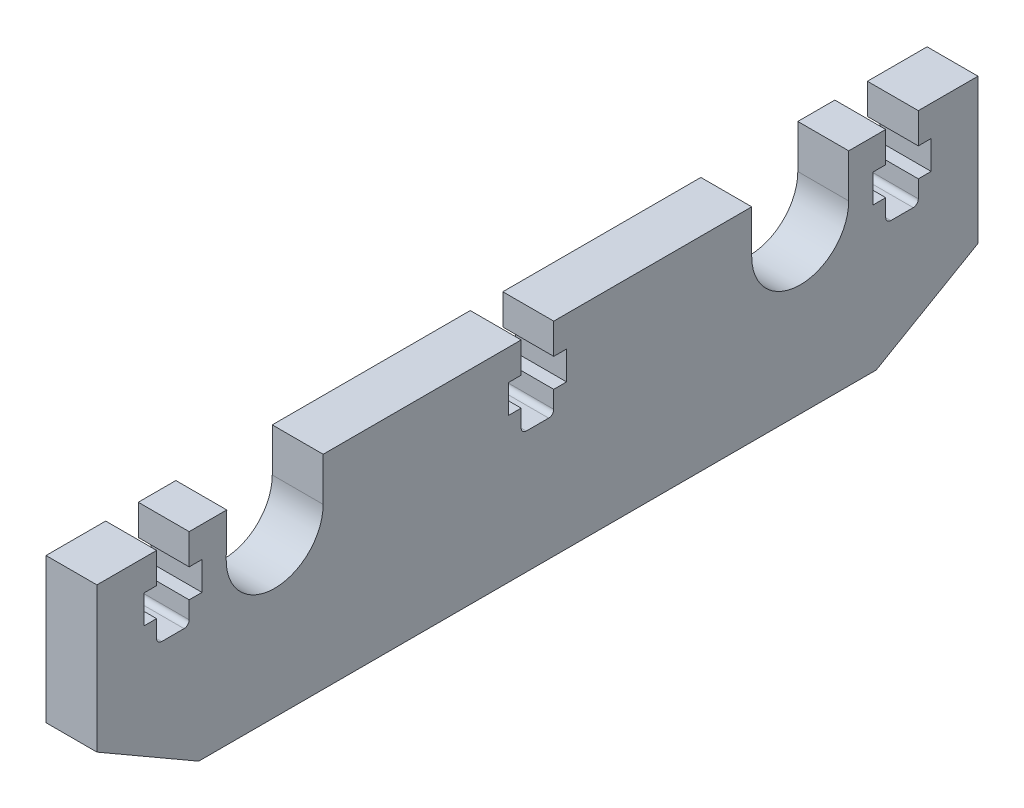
ISO-10303-21;
HEADER;
FILE_DESCRIPTION(('STEP AP214'),'2;1');
FILE_NAME('part.step','',(''),(''),'','','');
FILE_SCHEMA(('AUTOMOTIVE_DESIGN { 1 0 10303 214 1 1 1 1 }'));
ENDSEC;
DATA;
#1=APPLICATION_CONTEXT('core data for automotive mechanical design processes');
#2=APPLICATION_PROTOCOL_DEFINITION('international standard','automotive_design',2000,#1);
#3=PRODUCT_CONTEXT('',#1,'mechanical');
#4=PRODUCT('Part','Part','',(#3));
#5=PRODUCT_RELATED_PRODUCT_CATEGORY('part','',(#4));
#6=PRODUCT_DEFINITION_FORMATION('','',#4);
#7=PRODUCT_DEFINITION_CONTEXT('part definition',#1,'design');
#8=PRODUCT_DEFINITION('design','',#6,#7);
#9=PRODUCT_DEFINITION_SHAPE('','',#8);
#10=(LENGTH_UNIT() NAMED_UNIT(*) SI_UNIT(.MILLI.,.METRE.));
#11=(NAMED_UNIT(*) PLANE_ANGLE_UNIT() SI_UNIT($,.RADIAN.));
#12=(NAMED_UNIT(*) SI_UNIT($,.STERADIAN.) SOLID_ANGLE_UNIT());
#13=UNCERTAINTY_MEASURE_WITH_UNIT(LENGTH_MEASURE(1.E-05),#10,'distance_accuracy_value','');
#14=(GEOMETRIC_REPRESENTATION_CONTEXT(3) GLOBAL_UNCERTAINTY_ASSIGNED_CONTEXT((#13)) GLOBAL_UNIT_ASSIGNED_CONTEXT((#10,
#11,#12)) REPRESENTATION_CONTEXT('',''));
#15=CARTESIAN_POINT('',(0.,0.,0.));
#16=DIRECTION('',(0.,0.,1.));
#17=DIRECTION('',(1.,0.,0.));
#18=AXIS2_PLACEMENT_3D('',#15,#16,#17);
#19=CARTESIAN_POINT('',(-115.75,1.0875,-69.235531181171));
#20=DIRECTION('',(0.,1.,0.));
#21=DIRECTION('',(0.,0.,1.));
#22=AXIS2_PLACEMENT_3D('',#19,#20,#21);
#23=PLANE('',#22);
#24=DIRECTION('',(-1.,0.,0.));
#25=VECTOR('',#24,1.);
#26=CARTESIAN_POINT('',(174.,1.08750000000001,-1.6));
#27=LINE('',#26,#25);
#28=CARTESIAN_POINT('',(-110.75,1.08750000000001,-1.6));
#29=VERTEX_POINT('',#28);
#30=CARTESIAN_POINT('',(-115.75,1.08750000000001,-1.6));
#31=VERTEX_POINT('',#30);
#32=EDGE_CURVE('E402',#29,#31,#27,.T.);
#33=ORIENTED_EDGE('',*,*,#32,.F.);
#34=DIRECTION('',(0.,0.,1.));
#35=VECTOR('',#34,1.);
#36=CARTESIAN_POINT('',(-110.75,1.0875,-69.235531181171));
#37=LINE('',#36,#35);
#38=CARTESIAN_POINT('',(-110.75,1.08749999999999,-21.05));
#39=VERTEX_POINT('',#38);
#40=EDGE_CURVE('E668',#39,#29,#37,.T.);
#41=ORIENTED_EDGE('',*,*,#40,.F.);
#42=DIRECTION('',(1.,0.,0.));
#43=VECTOR('',#42,1.);
#44=CARTESIAN_POINT('',(-115.75,1.08749999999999,-21.05));
#45=LINE('',#44,#43);
#46=CARTESIAN_POINT('',(-115.75,1.08749999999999,-21.05));
#47=VERTEX_POINT('',#46);
#48=EDGE_CURVE('E680',#47,#39,#45,.T.);
#49=ORIENTED_EDGE('',*,*,#48,.F.);
#50=DIRECTION('',(0.,0.,1.));
#51=VECTOR('',#50,1.);
#52=CARTESIAN_POINT('',(-115.75,1.0875,-69.235531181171));
#53=LINE('',#52,#51);
#54=EDGE_CURVE('E633',#47,#31,#53,.T.);
#55=ORIENTED_EDGE('',*,*,#54,.T.);
#56=EDGE_LOOP('',(#33,#41,#49,#55));
#57=FACE_BOUND('',#56,.T.);
#58=ADVANCED_FACE('F32',(#57),#23,.T.);
#59=CARTESIAN_POINT('',(-115.75,1.08749999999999,-69.235531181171));
#60=DIRECTION('',(0.,1.,0.));
#61=DIRECTION('',(0.,0.,1.));
#62=AXIS2_PLACEMENT_3D('',#59,#60,#61);
#63=PLANE('',#62);
#64=DIRECTION('',(-1.,0.,0.));
#65=VECTOR('',#64,1.);
#66=CARTESIAN_POINT('',(174.,1.08749999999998,34.2125));
#67=LINE('',#66,#65);
#68=CARTESIAN_POINT('',(-110.75,1.08749999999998,34.2125));
#69=VERTEX_POINT('',#68);
#70=CARTESIAN_POINT('',(-115.75,1.08749999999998,34.2125));
#71=VERTEX_POINT('',#70);
#72=EDGE_CURVE('E517',#69,#71,#67,.T.);
#73=ORIENTED_EDGE('',*,*,#72,.F.);
#74=DIRECTION('',(0.,0.,1.));
#75=VECTOR('',#74,1.);
#76=CARTESIAN_POINT('',(-110.75,1.08749999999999,-69.235531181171));
#77=LINE('',#76,#75);
#78=CARTESIAN_POINT('',(-110.75,1.08749999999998,30.5192604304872));
#79=VERTEX_POINT('',#78);
#80=EDGE_CURVE('E645',#79,#69,#77,.T.);
#81=ORIENTED_EDGE('',*,*,#80,.F.);
#82=DIRECTION('',(1.,0.,0.));
#83=VECTOR('',#82,1.);
#84=CARTESIAN_POINT('',(-115.75,1.08749999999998,30.5192604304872));
#85=LINE('',#84,#83);
#86=CARTESIAN_POINT('',(-115.75,1.08749999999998,30.5192604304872));
#87=VERTEX_POINT('',#86);
#88=EDGE_CURVE('E695',#87,#79,#85,.T.);
#89=ORIENTED_EDGE('',*,*,#88,.F.);
#90=DIRECTION('',(0.,0.,1.));
#91=VECTOR('',#90,1.);
#92=CARTESIAN_POINT('',(-115.75,1.08749999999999,-69.235531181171));
#93=LINE('',#92,#91);
#94=EDGE_CURVE('E610',#87,#71,#93,.T.);
#95=ORIENTED_EDGE('',*,*,#94,.T.);
#96=EDGE_LOOP('',(#73,#81,#89,#95));
#97=FACE_BOUND('',#96,.T.);
#98=ADVANCED_FACE('F877',(#97),#63,.T.);
#99=CARTESIAN_POINT('',(-115.75,1.0875,-69.235531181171));
#100=DIRECTION('',(0.,1.,0.));
#101=DIRECTION('',(0.,0.,1.));
#102=AXIS2_PLACEMENT_3D('',#99,#100,#101);
#103=PLANE('',#102);
#104=DIRECTION('',(-1.,0.,0.));
#105=VECTOR('',#104,1.);
#106=CARTESIAN_POINT('',(174.,1.0875,-37.4125));
#107=LINE('',#106,#105);
#108=CARTESIAN_POINT('',(-110.75,1.0875,-37.4125));
#109=VERTEX_POINT('',#108);
#110=CARTESIAN_POINT('',(-115.75,1.0875,-37.4125));
#111=VERTEX_POINT('',#110);
#112=EDGE_CURVE('E573',#109,#111,#107,.T.);
#113=ORIENTED_EDGE('',*,*,#112,.F.);
#114=DIRECTION('',(0.,0.,1.));
#115=VECTOR('',#114,1.);
#116=CARTESIAN_POINT('',(-110.75,1.0875,-69.235531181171));
#117=LINE('',#116,#115);
#118=CARTESIAN_POINT('',(-110.75,1.0875,-43.275));
#119=VERTEX_POINT('',#118);
#120=EDGE_CURVE('E656',#119,#109,#117,.T.);
#121=ORIENTED_EDGE('',*,*,#120,.F.);
#122=DIRECTION('',(1.,0.,0.));
#123=VECTOR('',#122,1.);
#124=CARTESIAN_POINT('',(-115.75,1.0875,-43.275));
#125=LINE('',#124,#123);
#126=CARTESIAN_POINT('',(-115.75,1.0875,-43.275));
#127=VERTEX_POINT('',#126);
#128=EDGE_CURVE('E690',#127,#119,#125,.T.);
#129=ORIENTED_EDGE('',*,*,#128,.F.);
#130=DIRECTION('',(0.,0.,1.));
#131=VECTOR('',#130,1.);
#132=CARTESIAN_POINT('',(-115.75,1.0875,-69.235531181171));
#133=LINE('',#132,#131);
#134=EDGE_CURVE('E621',#127,#111,#133,.T.);
#135=ORIENTED_EDGE('',*,*,#134,.T.);
#136=EDGE_LOOP('',(#113,#121,#129,#135));
#137=FACE_BOUND('',#136,.T.);
#138=ADVANCED_FACE('F1030',(#137),#103,.T.);
#139=CARTESIAN_POINT('',(-115.75,-3.17500000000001,25.8125));
#140=DIRECTION('',(1.,0.,0.));
#141=DIRECTION('',(0.,0.,-1.));
#142=AXIS2_PLACEMENT_3D('',#139,#140,#141);
#143=CYLINDRICAL_SURFACE('',#142,4.7625);
#144=CARTESIAN_POINT('',(-110.75,-3.17500000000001,25.8125));
#145=DIRECTION('',(1.,0.,0.));
#146=DIRECTION('',(0.,0.,-1.));
#147=AXIS2_PLACEMENT_3D('',#144,#145,#146);
#148=CIRCLE('',#147,4.7625);
#149=CARTESIAN_POINT('',(-110.75,-3.05046542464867,30.573371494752));
#150=VERTEX_POINT('',#149);
#151=CARTESIAN_POINT('',(-110.75,-3.17500000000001,21.05));
#152=VERTEX_POINT('',#151);
#153=EDGE_CURVE('E575',#150,#152,#148,.T.);
#154=ORIENTED_EDGE('',*,*,#153,.T.);
#155=DIRECTION('',(1.,0.,0.));
#156=VECTOR('',#155,1.);
#157=CARTESIAN_POINT('',(-115.75,-3.17500000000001,21.05));
#158=LINE('',#157,#156);
#159=CARTESIAN_POINT('',(-115.75,-3.17500000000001,21.05));
#160=VERTEX_POINT('',#159);
#161=EDGE_CURVE('E673',#160,#152,#158,.T.);
#162=ORIENTED_EDGE('',*,*,#161,.F.);
#163=CARTESIAN_POINT('',(-115.75,-3.17500000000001,25.8125));
#164=DIRECTION('',(1.,0.,0.));
#165=DIRECTION('',(0.,0.,-1.));
#166=AXIS2_PLACEMENT_3D('',#163,#164,#165);
#167=CIRCLE('',#166,4.7625);
#168=CARTESIAN_POINT('',(-115.75,-3.05046542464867,30.573371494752));
#169=VERTEX_POINT('',#168);
#170=EDGE_CURVE('E602',#169,#160,#167,.T.);
#171=ORIENTED_EDGE('',*,*,#170,.F.);
#172=DIRECTION('',(1.,0.,0.));
#173=VECTOR('',#172,1.);
#174=CARTESIAN_POINT('',(-115.75,-3.05046542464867,30.573371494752));
#175=LINE('',#174,#173);
#176=EDGE_CURVE('E638',#169,#150,#175,.T.);
#177=ORIENTED_EDGE('',*,*,#176,.T.);
#178=EDGE_LOOP('',(#154,#162,#171,#177));
#179=FACE_BOUND('',#178,.T.);
#180=ADVANCED_FACE('F887',(#179),#143,.F.);
#181=CARTESIAN_POINT('',(-115.75,-8.91250000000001,21.05));
#182=DIRECTION('',(0.,0.,-1.));
#183=DIRECTION('',(-1.,0.,0.));
#184=AXIS2_PLACEMENT_3D('',#181,#182,#183);
#185=PLANE('',#184);
#186=DIRECTION('',(0.,1.,0.));
#187=VECTOR('',#186,1.);
#188=CARTESIAN_POINT('',(-110.75,-8.91250000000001,21.05));
#189=LINE('',#188,#187);
#190=CARTESIAN_POINT('',(-110.75,1.08749999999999,21.05));
#191=VERTEX_POINT('',#190);
#192=EDGE_CURVE('E606',#152,#191,#189,.T.);
#193=ORIENTED_EDGE('',*,*,#192,.T.);
#194=DIRECTION('',(1.,0.,0.));
#195=VECTOR('',#194,1.);
#196=CARTESIAN_POINT('',(-115.75,1.08749999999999,21.05));
#197=LINE('',#196,#195);
#198=CARTESIAN_POINT('',(-115.75,1.08749999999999,21.05));
#199=VERTEX_POINT('',#198);
#200=EDGE_CURVE('E677',#199,#191,#197,.T.);
#201=ORIENTED_EDGE('',*,*,#200,.F.);
#202=DIRECTION('',(0.,1.,0.));
#203=VECTOR('',#202,1.);
#204=CARTESIAN_POINT('',(-115.75,-8.91250000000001,21.05));
#205=LINE('',#204,#203);
#206=EDGE_CURVE('E635',#160,#199,#205,.T.);
#207=ORIENTED_EDGE('',*,*,#206,.F.);
#208=ORIENTED_EDGE('',*,*,#161,.T.);
#209=EDGE_LOOP('',(#193,#201,#207,#208));
#210=FACE_BOUND('',#209,.T.);
#211=ADVANCED_FACE('F890',(#210),#185,.F.);
#212=DIRECTION('',(-1.,0.,0.));
#213=VECTOR('',#212,1.);
#214=CARTESIAN_POINT('',(174.,1.08750000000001,1.6));
#215=LINE('',#214,#213);
#216=CARTESIAN_POINT('',(-110.75,1.08750000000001,1.6));
#217=VERTEX_POINT('',#216);
#218=CARTESIAN_POINT('',(-115.75,1.08750000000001,1.6));
#219=VERTEX_POINT('',#218);
#220=EDGE_CURVE('E444',#217,#219,#215,.T.);
#221=ORIENTED_EDGE('',*,*,#220,.T.);
#222=EDGE_CURVE('E632',#219,#199,#53,.T.);
#223=ORIENTED_EDGE('',*,*,#222,.T.);
#224=ORIENTED_EDGE('',*,*,#200,.T.);
#225=EDGE_CURVE('E667',#217,#191,#37,.T.);
#226=ORIENTED_EDGE('',*,*,#225,.F.);
#227=EDGE_LOOP('',(#221,#223,#224,#226));
#228=FACE_BOUND('',#227,.T.);
#229=ADVANCED_FACE('F893',(#228),#23,.T.);
#230=CARTESIAN_POINT('',(-115.75,-8.91249999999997,-21.05));
#231=DIRECTION('',(0.,0.,-1.));
#232=DIRECTION('',(0.,1.,0.));
#233=AXIS2_PLACEMENT_3D('',#230,#231,#232);
#234=PLANE('',#233);
#235=DIRECTION('',(0.,1.,0.));
#236=VECTOR('',#235,1.);
#237=CARTESIAN_POINT('',(-110.75,-8.91249999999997,-21.05));
#238=LINE('',#237,#236);
#239=CARTESIAN_POINT('',(-110.75,-3.17500000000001,-21.05));
#240=VERTEX_POINT('',#239);
#241=EDGE_CURVE('E664',#240,#39,#238,.T.);
#242=ORIENTED_EDGE('',*,*,#241,.F.);
#243=DIRECTION('',(1.,0.,0.));
#244=VECTOR('',#243,1.);
#245=CARTESIAN_POINT('',(-115.75,-3.17500000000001,-21.05));
#246=LINE('',#245,#244);
#247=CARTESIAN_POINT('',(-115.75,-3.17500000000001,-21.05));
#248=VERTEX_POINT('',#247);
#249=EDGE_CURVE('E682',#248,#240,#246,.T.);
#250=ORIENTED_EDGE('',*,*,#249,.F.);
#251=DIRECTION('',(0.,1.,0.));
#252=VECTOR('',#251,1.);
#253=CARTESIAN_POINT('',(-115.75,-8.91249999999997,-21.05));
#254=LINE('',#253,#252);
#255=EDGE_CURVE('E629',#248,#47,#254,.T.);
#256=ORIENTED_EDGE('',*,*,#255,.T.);
#257=ORIENTED_EDGE('',*,*,#48,.T.);
#258=EDGE_LOOP('',(#242,#250,#256,#257));
#259=FACE_BOUND('',#258,.T.);
#260=ADVANCED_FACE('F951',(#259),#234,.T.);
#261=CARTESIAN_POINT('',(-115.75,-3.17500000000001,-25.8125));
#262=DIRECTION('',(1.,0.,0.));
#263=DIRECTION('',(0.,0.,-1.));
#264=AXIS2_PLACEMENT_3D('',#261,#262,#263);
#265=CYLINDRICAL_SURFACE('',#264,4.76249999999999);
#266=CARTESIAN_POINT('',(-110.75,-3.17500000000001,-25.8125));
#267=DIRECTION('',(1.,0.,0.));
#268=DIRECTION('',(0.,0.,-1.));
#269=AXIS2_PLACEMENT_3D('',#266,#267,#268);
#270=CIRCLE('',#269,4.76249999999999);
#271=CARTESIAN_POINT('',(-110.75,-3.17500000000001,-30.575));
#272=VERTEX_POINT('',#271);
#273=EDGE_CURVE('E662',#240,#272,#270,.T.);
#274=ORIENTED_EDGE('',*,*,#273,.T.);
#275=DIRECTION('',(1.,0.,0.));
#276=VECTOR('',#275,1.);
#277=CARTESIAN_POINT('',(-115.75,-3.17500000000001,-30.575));
#278=LINE('',#277,#276);
#279=CARTESIAN_POINT('',(-115.75,-3.17500000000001,-30.575));
#280=VERTEX_POINT('',#279);
#281=EDGE_CURVE('E684',#280,#272,#278,.T.);
#282=ORIENTED_EDGE('',*,*,#281,.F.);
#283=CARTESIAN_POINT('',(-115.75,-3.17500000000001,-25.8125));
#284=DIRECTION('',(1.,0.,0.));
#285=DIRECTION('',(0.,0.,-1.));
#286=AXIS2_PLACEMENT_3D('',#283,#284,#285);
#287=CIRCLE('',#286,4.76249999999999);
#288=EDGE_CURVE('E627',#248,#280,#287,.T.);
#289=ORIENTED_EDGE('',*,*,#288,.F.);
#290=ORIENTED_EDGE('',*,*,#249,.T.);
#291=EDGE_LOOP('',(#274,#282,#289,#290));
#292=FACE_BOUND('',#291,.T.);
#293=ADVANCED_FACE('F956',(#292),#265,.F.);
#294=CARTESIAN_POINT('',(-115.75,-8.91250000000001,-30.575));
#295=DIRECTION('',(0.,0.,-1.));
#296=DIRECTION('',(-1.,0.,0.));
#297=AXIS2_PLACEMENT_3D('',#294,#295,#296);
#298=PLANE('',#297);
#299=DIRECTION('',(0.,1.,0.));
#300=VECTOR('',#299,1.);
#301=CARTESIAN_POINT('',(-110.75,-8.91250000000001,-30.575));
#302=LINE('',#301,#300);
#303=CARTESIAN_POINT('',(-110.75,1.08749999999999,-30.575));
#304=VERTEX_POINT('',#303);
#305=EDGE_CURVE('E659',#272,#304,#302,.T.);
#306=ORIENTED_EDGE('',*,*,#305,.T.);
#307=DIRECTION('',(1.,0.,0.));
#308=VECTOR('',#307,1.);
#309=CARTESIAN_POINT('',(-115.75,1.08749999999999,-30.575));
#310=LINE('',#309,#308);
#311=CARTESIAN_POINT('',(-115.75,1.08749999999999,-30.575));
#312=VERTEX_POINT('',#311);
#313=EDGE_CURVE('E687',#312,#304,#310,.T.);
#314=ORIENTED_EDGE('',*,*,#313,.F.);
#315=DIRECTION('',(0.,1.,0.));
#316=VECTOR('',#315,1.);
#317=CARTESIAN_POINT('',(-115.75,-8.91250000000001,-30.575));
#318=LINE('',#317,#316);
#319=EDGE_CURVE('E624',#280,#312,#318,.T.);
#320=ORIENTED_EDGE('',*,*,#319,.F.);
#321=ORIENTED_EDGE('',*,*,#281,.T.);
#322=EDGE_LOOP('',(#306,#314,#320,#321));
#323=FACE_BOUND('',#322,.T.);
#324=ADVANCED_FACE('F962',(#323),#298,.F.);
#325=DIRECTION('',(-1.,0.,0.));
#326=VECTOR('',#325,1.);
#327=CARTESIAN_POINT('',(174.,1.0875,-34.2125));
#328=LINE('',#327,#326);
#329=CARTESIAN_POINT('',(-110.75,1.0875,-34.2125));
#330=VERTEX_POINT('',#329);
#331=CARTESIAN_POINT('',(-115.75,1.0875,-34.2125));
#332=VERTEX_POINT('',#331);
#333=EDGE_CURVE('E576',#330,#332,#328,.T.);
#334=ORIENTED_EDGE('',*,*,#333,.T.);
#335=EDGE_CURVE('E620',#332,#312,#133,.T.);
#336=ORIENTED_EDGE('',*,*,#335,.T.);
#337=ORIENTED_EDGE('',*,*,#313,.T.);
#338=EDGE_CURVE('E655',#330,#304,#117,.T.);
#339=ORIENTED_EDGE('',*,*,#338,.F.);
#340=EDGE_LOOP('',(#334,#336,#337,#339));
#341=FACE_BOUND('',#340,.T.);
#342=ADVANCED_FACE('F966',(#341),#103,.T.);
#343=CARTESIAN_POINT('',(-115.75,-8.91250000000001,-43.275));
#344=DIRECTION('',(0.,0.,1.));
#345=DIRECTION('',(1.,0.,0.));
#346=AXIS2_PLACEMENT_3D('',#343,#344,#345);
#347=PLANE('',#346);
#348=DIRECTION('',(0.,-1.,0.));
#349=VECTOR('',#348,1.);
#350=CARTESIAN_POINT('',(-110.75,-8.91250000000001,-43.275));
#351=LINE('',#350,#349);
#352=CARTESIAN_POINT('',(-110.75,-13.1389973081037,-43.275));
#353=VERTEX_POINT('',#352);
#354=EDGE_CURVE('E653',#119,#353,#351,.T.);
#355=ORIENTED_EDGE('',*,*,#354,.T.);
#356=DIRECTION('',(-1.,0.,0.));
#357=VECTOR('',#356,1.);
#358=CARTESIAN_POINT('',(-115.75,-13.1389973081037,-43.275));
#359=LINE('',#358,#357);
#360=CARTESIAN_POINT('',(-115.75,-13.1389973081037,-43.275));
#361=VERTEX_POINT('',#360);
#362=EDGE_CURVE('E40',#353,#361,#359,.T.);
#363=ORIENTED_EDGE('',*,*,#362,.T.);
#364=DIRECTION('',(0.,-1.,0.));
#365=VECTOR('',#364,1.);
#366=CARTESIAN_POINT('',(-115.75,-8.91250000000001,-43.275));
#367=LINE('',#366,#365);
#368=EDGE_CURVE('E618',#127,#361,#367,.T.);
#369=ORIENTED_EDGE('',*,*,#368,.F.);
#370=ORIENTED_EDGE('',*,*,#128,.T.);
#371=EDGE_LOOP('',(#355,#363,#369,#370));
#372=FACE_BOUND('',#371,.T.);
#373=ADVANCED_FACE('F1032',(#372),#347,.F.);
#374=CARTESIAN_POINT('',(-115.75,-18.9125,-69.235531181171));
#375=DIRECTION('',(0.,1.,0.));
#376=DIRECTION('',(0.,0.,1.));
#377=AXIS2_PLACEMENT_3D('',#374,#375,#376);
#378=PLANE('',#377);
#379=DIRECTION('',(0.,0.,1.));
#380=VECTOR('',#379,1.);
#381=CARTESIAN_POINT('',(-115.75,-18.9125,-69.235531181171));
#382=LINE('',#381,#380);
#383=CARTESIAN_POINT('',(-115.75,-18.9125,-33.2749999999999));
#384=VERTEX_POINT('',#383);
#385=CARTESIAN_POINT('',(-115.75,-18.9125000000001,33.2749999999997));
#386=VERTEX_POINT('',#385);
#387=EDGE_CURVE('E616',#384,#386,#382,.T.);
#388=ORIENTED_EDGE('',*,*,#387,.F.);
#389=DIRECTION('',(1.,0.,0.));
#390=VECTOR('',#389,1.);
#391=CARTESIAN_POINT('',(-115.75,-18.9125,-33.2749999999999));
#392=LINE('',#391,#390);
#393=CARTESIAN_POINT('',(-110.75,-18.9125,-33.2749999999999));
#394=VERTEX_POINT('',#393);
#395=EDGE_CURVE('E788',#384,#394,#392,.T.);
#396=ORIENTED_EDGE('',*,*,#395,.T.);
#397=DIRECTION('',(0.,0.,1.));
#398=VECTOR('',#397,1.);
#399=CARTESIAN_POINT('',(-110.75,-18.9125,-69.235531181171));
#400=LINE('',#399,#398);
#401=CARTESIAN_POINT('',(-110.75,-18.9125,33.275));
#402=VERTEX_POINT('',#401);
#403=EDGE_CURVE('E651',#394,#402,#400,.T.);
#404=ORIENTED_EDGE('',*,*,#403,.T.);
#405=DIRECTION('',(-1.,0.,0.));
#406=VECTOR('',#405,1.);
#407=CARTESIAN_POINT('',(-115.75,-18.9125,33.275));
#408=LINE('',#407,#406);
#409=EDGE_CURVE('E783',#402,#386,#408,.T.);
#410=ORIENTED_EDGE('',*,*,#409,.T.);
#411=EDGE_LOOP('',(#388,#396,#404,#410));
#412=FACE_BOUND('',#411,.T.);
#413=ADVANCED_FACE('F794',(#412),#378,.F.);
#414=CARTESIAN_POINT('',(-115.75,-8.91249999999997,43.275));
#415=DIRECTION('',(0.,0.,1.));
#416=DIRECTION('',(0.,-1.,0.));
#417=AXIS2_PLACEMENT_3D('',#414,#415,#416);
#418=PLANE('',#417);
#419=DIRECTION('',(0.,-1.,0.));
#420=VECTOR('',#419,1.);
#421=CARTESIAN_POINT('',(-115.75,-8.91249999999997,43.275));
#422=LINE('',#421,#420);
#423=CARTESIAN_POINT('',(-115.75,1.08749999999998,43.275));
#424=VERTEX_POINT('',#423);
#425=CARTESIAN_POINT('',(-115.75,-13.1389973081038,43.275));
#426=VERTEX_POINT('',#425);
#427=EDGE_CURVE('E613',#424,#426,#422,.T.);
#428=ORIENTED_EDGE('',*,*,#427,.T.);
#429=DIRECTION('',(1.,0.,0.));
#430=VECTOR('',#429,1.);
#431=CARTESIAN_POINT('',(-110.75,-13.1389973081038,43.275));
#432=LINE('',#431,#430);
#433=CARTESIAN_POINT('',(-110.75,-13.1389973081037,43.275));
#434=VERTEX_POINT('',#433);
#435=EDGE_CURVE('E777',#426,#434,#432,.T.);
#436=ORIENTED_EDGE('',*,*,#435,.T.);
#437=DIRECTION('',(0.,-1.,0.));
#438=VECTOR('',#437,1.);
#439=CARTESIAN_POINT('',(-110.75,-8.91249999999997,43.275));
#440=LINE('',#439,#438);
#441=CARTESIAN_POINT('',(-110.75,1.08749999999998,43.275));
#442=VERTEX_POINT('',#441);
#443=EDGE_CURVE('E648',#442,#434,#440,.T.);
#444=ORIENTED_EDGE('',*,*,#443,.F.);
#445=DIRECTION('',(1.,0.,0.));
#446=VECTOR('',#445,1.);
#447=CARTESIAN_POINT('',(-115.75,1.08749999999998,43.275));
#448=LINE('',#447,#446);
#449=EDGE_CURVE('E692',#424,#442,#448,.T.);
#450=ORIENTED_EDGE('',*,*,#449,.F.);
#451=EDGE_LOOP('',(#428,#436,#444,#450));
#452=FACE_BOUND('',#451,.T.);
#453=ADVANCED_FACE('F808',(#452),#418,.T.);
#454=DIRECTION('',(-1.,0.,0.));
#455=VECTOR('',#454,1.);
#456=CARTESIAN_POINT('',(174.,1.08749999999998,37.4125));
#457=LINE('',#456,#455);
#458=CARTESIAN_POINT('',(-110.75,1.08749999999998,37.4125));
#459=VERTEX_POINT('',#458);
#460=CARTESIAN_POINT('',(-115.75,1.08749999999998,37.4125));
#461=VERTEX_POINT('',#460);
#462=EDGE_CURVE('E519',#459,#461,#457,.T.);
#463=ORIENTED_EDGE('',*,*,#462,.T.);
#464=EDGE_CURVE('E609',#461,#424,#93,.T.);
#465=ORIENTED_EDGE('',*,*,#464,.T.);
#466=ORIENTED_EDGE('',*,*,#449,.T.);
#467=EDGE_CURVE('E644',#459,#442,#77,.T.);
#468=ORIENTED_EDGE('',*,*,#467,.F.);
#469=EDGE_LOOP('',(#463,#465,#466,#468));
#470=FACE_BOUND('',#469,.T.);
#471=ADVANCED_FACE('F811',(#470),#63,.T.);
#472=CARTESIAN_POINT('',(-115.75,-7.60654664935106,30.6329501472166));
#473=DIRECTION('',(0.,-0.0130756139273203,-0.999914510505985));
#474=DIRECTION('',(0.,0.999914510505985,-0.0130756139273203));
#475=AXIS2_PLACEMENT_3D('',#472,#473,#474);
#476=PLANE('',#475);
#477=DIRECTION('',(0.,0.999914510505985,-0.0130756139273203));
#478=VECTOR('',#477,1.);
#479=CARTESIAN_POINT('',(-110.75,-7.60654664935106,30.6329501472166));
#480=LINE('',#479,#478);
#481=EDGE_CURVE('E641',#150,#79,#480,.T.);
#482=ORIENTED_EDGE('',*,*,#481,.F.);
#483=ORIENTED_EDGE('',*,*,#176,.F.);
#484=DIRECTION('',(0.,0.999914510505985,-0.0130756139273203));
#485=VECTOR('',#484,1.);
#486=CARTESIAN_POINT('',(-115.75,-7.60654664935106,30.6329501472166));
#487=LINE('',#486,#485);
#488=EDGE_CURVE('E605',#169,#87,#487,.T.);
#489=ORIENTED_EDGE('',*,*,#488,.T.);
#490=ORIENTED_EDGE('',*,*,#88,.T.);
#491=EDGE_LOOP('',(#482,#483,#489,#490));
#492=FACE_BOUND('',#491,.T.);
#493=ADVANCED_FACE('F881',(#492),#476,.T.);
#494=CARTESIAN_POINT('',(-115.75,-8.91250000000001,-69.235531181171));
#495=DIRECTION('',(1.,0.,0.));
#496=DIRECTION('',(0.,0.,-1.));
#497=AXIS2_PLACEMENT_3D('',#494,#495,#496);
#498=PLANE('',#497);
#499=ORIENTED_EDGE('',*,*,#368,.T.);
#500=DIRECTION('',(0.,0.499999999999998,-0.86602540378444));
#501=VECTOR('',#500,1.);
#502=CARTESIAN_POINT('',(-115.75,-18.9125,-33.2749999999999));
#503=LINE('',#502,#501);
#504=EDGE_CURVE('E11',#361,#384,#503,.F.);
#505=ORIENTED_EDGE('',*,*,#504,.T.);
#506=ORIENTED_EDGE('',*,*,#387,.T.);
#507=DIRECTION('',(0.,0.499999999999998,0.86602540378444));
#508=VECTOR('',#507,1.);
#509=CARTESIAN_POINT('',(-115.75,-13.1389973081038,43.275));
#510=LINE('',#509,#508);
#511=EDGE_CURVE('E786',#386,#426,#510,.T.);
#512=ORIENTED_EDGE('',*,*,#511,.T.);
#513=ORIENTED_EDGE('',*,*,#427,.F.);
#514=ORIENTED_EDGE('',*,*,#464,.F.);
#515=DIRECTION('',(0.,1.,0.));
#516=VECTOR('',#515,1.);
#517=CARTESIAN_POINT('',(-115.75,1.08749999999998,37.4125));
#518=LINE('',#517,#516);
#519=CARTESIAN_POINT('',(-115.75,-1.91250000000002,37.4125));
#520=VERTEX_POINT('',#519);
#521=EDGE_CURVE('E488',#520,#461,#518,.T.);
#522=ORIENTED_EDGE('',*,*,#521,.F.);
#523=DIRECTION('',(0.,0.,-1.));
#524=VECTOR('',#523,1.);
#525=CARTESIAN_POINT('',(-115.75,-1.91250000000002,37.4125));
#526=LINE('',#525,#524);
#527=CARTESIAN_POINT('',(-115.75,-1.91250000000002,38.6725));
#528=VERTEX_POINT('',#527);
#529=EDGE_CURVE('E485',#528,#520,#526,.T.);
#530=ORIENTED_EDGE('',*,*,#529,.F.);
#531=DIRECTION('',(0.,1.,0.));
#532=VECTOR('',#531,1.);
#533=CARTESIAN_POINT('',(-115.75,-1.91250000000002,38.6725));
#534=LINE('',#533,#532);
#535=CARTESIAN_POINT('',(-115.75,-4.71250000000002,38.6725));
#536=VERTEX_POINT('',#535);
#537=EDGE_CURVE('E482',#536,#528,#534,.T.);
#538=ORIENTED_EDGE('',*,*,#537,.F.);
#539=DIRECTION('',(0.,0.,1.));
#540=VECTOR('',#539,1.);
#541=CARTESIAN_POINT('',(-115.75,-4.71250000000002,38.6725));
#542=LINE('',#541,#540);
#543=CARTESIAN_POINT('',(-115.75,-4.71250000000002,37.4125));
#544=VERTEX_POINT('',#543);
#545=EDGE_CURVE('E479',#544,#536,#542,.T.);
#546=ORIENTED_EDGE('',*,*,#545,.F.);
#547=DIRECTION('',(0.,1.,0.));
#548=VECTOR('',#547,1.);
#549=CARTESIAN_POINT('',(-115.75,-4.71250000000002,37.4125));
#550=LINE('',#549,#548);
#551=CARTESIAN_POINT('',(-115.75,-6.41250000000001,37.4125));
#552=VERTEX_POINT('',#551);
#553=EDGE_CURVE('E476',#552,#544,#550,.T.);
#554=ORIENTED_EDGE('',*,*,#553,.F.);
#555=CARTESIAN_POINT('',(-115.75,-6.41250000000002,36.9125));
#556=DIRECTION('',(-1.,0.,0.));
#557=DIRECTION('',(0.,0.,1.));
#558=AXIS2_PLACEMENT_3D('',#555,#556,#557);
#559=CIRCLE('',#558,0.5);
#560=CARTESIAN_POINT('',(-115.75,-6.91250000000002,36.9125));
#561=VERTEX_POINT('',#560);
#562=EDGE_CURVE('E473',#561,#552,#559,.T.);
#563=ORIENTED_EDGE('',*,*,#562,.F.);
#564=DIRECTION('',(0.,0.,1.));
#565=VECTOR('',#564,1.);
#566=CARTESIAN_POINT('',(-115.75,-6.91250000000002,36.9125));
#567=LINE('',#566,#565);
#568=CARTESIAN_POINT('',(-115.75,-6.91250000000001,34.7125));
#569=VERTEX_POINT('',#568);
#570=EDGE_CURVE('E470',#569,#561,#567,.T.);
#571=ORIENTED_EDGE('',*,*,#570,.F.);
#572=CARTESIAN_POINT('',(-115.75,-6.41250000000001,34.7125));
#573=DIRECTION('',(-1.,0.,0.));
#574=DIRECTION('',(0.,0.,-1.));
#575=AXIS2_PLACEMENT_3D('',#572,#573,#574);
#576=CIRCLE('',#575,0.5);
#577=CARTESIAN_POINT('',(-115.75,-6.4125,34.2125));
#578=VERTEX_POINT('',#577);
#579=EDGE_CURVE('E443',#578,#569,#576,.T.);
#580=ORIENTED_EDGE('',*,*,#579,.F.);
#581=DIRECTION('',(0.,-1.,0.));
#582=VECTOR('',#581,1.);
#583=CARTESIAN_POINT('',(-115.75,-4.71250000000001,34.2125));
#584=LINE('',#583,#582);
#585=CARTESIAN_POINT('',(-115.75,-4.71250000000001,34.2125));
#586=VERTEX_POINT('',#585);
#587=EDGE_CURVE('E502',#586,#578,#584,.T.);
#588=ORIENTED_EDGE('',*,*,#587,.F.);
#589=DIRECTION('',(0.,0.,1.));
#590=VECTOR('',#589,1.);
#591=CARTESIAN_POINT('',(-115.75,-4.71250000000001,32.9525));
#592=LINE('',#591,#590);
#593=CARTESIAN_POINT('',(-115.75,-4.71250000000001,32.9525));
#594=VERTEX_POINT('',#593);
#595=EDGE_CURVE('E499',#594,#586,#592,.T.);
#596=ORIENTED_EDGE('',*,*,#595,.F.);
#597=DIRECTION('',(0.,-1.,0.));
#598=VECTOR('',#597,1.);
#599=CARTESIAN_POINT('',(-115.75,-1.91250000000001,32.9525));
#600=LINE('',#599,#598);
#601=CARTESIAN_POINT('',(-115.75,-1.91250000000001,32.9525));
#602=VERTEX_POINT('',#601);
#603=EDGE_CURVE('E496',#602,#594,#600,.T.);
#604=ORIENTED_EDGE('',*,*,#603,.F.);
#605=DIRECTION('',(0.,0.,-1.));
#606=VECTOR('',#605,1.);
#607=CARTESIAN_POINT('',(-115.75,-1.91250000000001,34.2125));
#608=LINE('',#607,#606);
#609=CARTESIAN_POINT('',(-115.75,-1.91250000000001,34.2125));
#610=VERTEX_POINT('',#609);
#611=EDGE_CURVE('E493',#610,#602,#608,.T.);
#612=ORIENTED_EDGE('',*,*,#611,.F.);
#613=DIRECTION('',(0.,-1.,0.));
#614=VECTOR('',#613,1.);
#615=CARTESIAN_POINT('',(-115.75,1.08749999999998,34.2125));
#616=LINE('',#615,#614);
#617=EDGE_CURVE('E490',#71,#610,#616,.T.);
#618=ORIENTED_EDGE('',*,*,#617,.F.);
#619=ORIENTED_EDGE('',*,*,#94,.F.);
#620=ORIENTED_EDGE('',*,*,#488,.F.);
#621=ORIENTED_EDGE('',*,*,#170,.T.);
#622=ORIENTED_EDGE('',*,*,#206,.T.);
#623=ORIENTED_EDGE('',*,*,#222,.F.);
#624=DIRECTION('',(0.,1.,0.));
#625=VECTOR('',#624,1.);
#626=CARTESIAN_POINT('',(-115.75,1.08750000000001,1.6));
#627=LINE('',#626,#625);
#628=CARTESIAN_POINT('',(-115.75,-1.91249999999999,1.6));
#629=VERTEX_POINT('',#628);
#630=EDGE_CURVE('E396',#629,#219,#627,.T.);
#631=ORIENTED_EDGE('',*,*,#630,.F.);
#632=DIRECTION('',(0.,0.,-1.));
#633=VECTOR('',#632,1.);
#634=CARTESIAN_POINT('',(-115.75,-1.91249999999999,1.6));
#635=LINE('',#634,#633);
#636=CARTESIAN_POINT('',(-115.75,-1.91249999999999,2.86));
#637=VERTEX_POINT('',#636);
#638=EDGE_CURVE('E438',#637,#629,#635,.T.);
#639=ORIENTED_EDGE('',*,*,#638,.F.);
#640=DIRECTION('',(0.,1.,0.));
#641=VECTOR('',#640,1.);
#642=CARTESIAN_POINT('',(-115.75,-1.91249999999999,2.86));
#643=LINE('',#642,#641);
#644=CARTESIAN_POINT('',(-115.75,-4.71249999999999,2.86));
#645=VERTEX_POINT('',#644);
#646=EDGE_CURVE('E435',#645,#637,#643,.T.);
#647=ORIENTED_EDGE('',*,*,#646,.F.);
#648=DIRECTION('',(0.,0.,1.));
#649=VECTOR('',#648,1.);
#650=CARTESIAN_POINT('',(-115.75,-4.71249999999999,2.86));
#651=LINE('',#650,#649);
#652=CARTESIAN_POINT('',(-115.75,-4.71249999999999,1.6));
#653=VERTEX_POINT('',#652);
#654=EDGE_CURVE('E432',#653,#645,#651,.T.);
#655=ORIENTED_EDGE('',*,*,#654,.F.);
#656=DIRECTION('',(0.,1.,0.));
#657=VECTOR('',#656,1.);
#658=CARTESIAN_POINT('',(-115.75,-4.71249999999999,1.6));
#659=LINE('',#658,#657);
#660=CARTESIAN_POINT('',(-115.75,-6.41249999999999,1.6));
#661=VERTEX_POINT('',#660);
#662=EDGE_CURVE('E429',#661,#653,#659,.T.);
#663=ORIENTED_EDGE('',*,*,#662,.F.);
#664=CARTESIAN_POINT('',(-115.75,-6.41249999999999,1.1));
#665=DIRECTION('',(-1.,0.,0.));
#666=DIRECTION('',(0.,0.,1.));
#667=AXIS2_PLACEMENT_3D('',#664,#665,#666);
#668=CIRCLE('',#667,0.500000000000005);
#669=CARTESIAN_POINT('',(-115.75,-6.9125,1.1));
#670=VERTEX_POINT('',#669);
#671=EDGE_CURVE('E426',#670,#661,#668,.T.);
#672=ORIENTED_EDGE('',*,*,#671,.F.);
#673=DIRECTION('',(0.,0.,1.));
#674=VECTOR('',#673,1.);
#675=CARTESIAN_POINT('',(-115.75,-6.9125,-1.1));
#676=LINE('',#675,#674);
#677=CARTESIAN_POINT('',(-115.75,-6.9125,-1.1));
#678=VERTEX_POINT('',#677);
#679=EDGE_CURVE('E423',#678,#670,#676,.T.);
#680=ORIENTED_EDGE('',*,*,#679,.F.);
#681=CARTESIAN_POINT('',(-115.75,-6.41249999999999,-1.1));
#682=DIRECTION('',(-1.,0.,0.));
#683=DIRECTION('',(0.,0.,-1.));
#684=AXIS2_PLACEMENT_3D('',#681,#682,#683);
#685=CIRCLE('',#684,0.500000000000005);
#686=CARTESIAN_POINT('',(-115.75,-6.41249999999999,-1.6));
#687=VERTEX_POINT('',#686);
#688=EDGE_CURVE('E420',#687,#678,#685,.T.);
#689=ORIENTED_EDGE('',*,*,#688,.F.);
#690=DIRECTION('',(0.,-1.,0.));
#691=VECTOR('',#690,1.);
#692=CARTESIAN_POINT('',(-115.75,-4.71249999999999,-1.6));
#693=LINE('',#692,#691);
#694=CARTESIAN_POINT('',(-115.75,-4.71249999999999,-1.6));
#695=VERTEX_POINT('',#694);
#696=EDGE_CURVE('E417',#695,#687,#693,.T.);
#697=ORIENTED_EDGE('',*,*,#696,.F.);
#698=DIRECTION('',(0.,0.,1.));
#699=VECTOR('',#698,1.);
#700=CARTESIAN_POINT('',(-115.75,-4.71249999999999,-2.86));
#701=LINE('',#700,#699);
#702=CARTESIAN_POINT('',(-115.75,-4.71249999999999,-2.86));
#703=VERTEX_POINT('',#702);
#704=EDGE_CURVE('E412',#703,#695,#701,.T.);
#705=ORIENTED_EDGE('',*,*,#704,.F.);
#706=DIRECTION('',(0.,-1.,0.));
#707=VECTOR('',#706,1.);
#708=CARTESIAN_POINT('',(-115.75,-1.91249999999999,-2.86));
#709=LINE('',#708,#707);
#710=CARTESIAN_POINT('',(-115.75,-1.91249999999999,-2.86));
#711=VERTEX_POINT('',#710);
#712=EDGE_CURVE('E410',#711,#703,#709,.T.);
#713=ORIENTED_EDGE('',*,*,#712,.F.);
#714=DIRECTION('',(0.,0.,-1.));
#715=VECTOR('',#714,1.);
#716=CARTESIAN_POINT('',(-115.75,-1.91249999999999,-1.6));
#717=LINE('',#716,#715);
#718=CARTESIAN_POINT('',(-115.75,-1.91249999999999,-1.6));
#719=VERTEX_POINT('',#718);
#720=EDGE_CURVE('E389',#719,#711,#717,.T.);
#721=ORIENTED_EDGE('',*,*,#720,.F.);
#722=DIRECTION('',(0.,-1.,0.));
#723=VECTOR('',#722,1.);
#724=CARTESIAN_POINT('',(-115.75,1.08750000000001,-1.6));
#725=LINE('',#724,#723);
#726=EDGE_CURVE('E399',#31,#719,#725,.T.);
#727=ORIENTED_EDGE('',*,*,#726,.F.);
#728=ORIENTED_EDGE('',*,*,#54,.F.);
#729=ORIENTED_EDGE('',*,*,#255,.F.);
#730=ORIENTED_EDGE('',*,*,#288,.T.);
#731=ORIENTED_EDGE('',*,*,#319,.T.);
#732=ORIENTED_EDGE('',*,*,#335,.F.);
#733=DIRECTION('',(0.,1.,0.));
#734=VECTOR('',#733,1.);
#735=CARTESIAN_POINT('',(-115.75,1.0875,-34.2125));
#736=LINE('',#735,#734);
#737=CARTESIAN_POINT('',(-115.75,-1.9125,-34.2125));
#738=VERTEX_POINT('',#737);
#739=EDGE_CURVE('E570',#738,#332,#736,.T.);
#740=ORIENTED_EDGE('',*,*,#739,.F.);
#741=DIRECTION('',(0.,0.,-1.));
#742=VECTOR('',#741,1.);
#743=CARTESIAN_POINT('',(-115.75,-1.9125,-34.2125));
#744=LINE('',#743,#742);
#745=CARTESIAN_POINT('',(-115.75,-1.9125,-32.9525));
#746=VERTEX_POINT('',#745);
#747=EDGE_CURVE('E567',#746,#738,#744,.T.);
#748=ORIENTED_EDGE('',*,*,#747,.F.);
#749=DIRECTION('',(0.,1.,0.));
#750=VECTOR('',#749,1.);
#751=CARTESIAN_POINT('',(-115.75,-1.9125,-32.9525));
#752=LINE('',#751,#750);
#753=CARTESIAN_POINT('',(-115.75,-4.7125,-32.9525));
#754=VERTEX_POINT('',#753);
#755=EDGE_CURVE('E564',#754,#746,#752,.T.);
#756=ORIENTED_EDGE('',*,*,#755,.F.);
#757=DIRECTION('',(0.,0.,1.));
#758=VECTOR('',#757,1.);
#759=CARTESIAN_POINT('',(-115.75,-4.7125,-32.9525));
#760=LINE('',#759,#758);
#761=CARTESIAN_POINT('',(-115.75,-4.7125,-34.2125));
#762=VERTEX_POINT('',#761);
#763=EDGE_CURVE('E561',#762,#754,#760,.T.);
#764=ORIENTED_EDGE('',*,*,#763,.F.);
#765=DIRECTION('',(0.,1.,0.));
#766=VECTOR('',#765,1.);
#767=CARTESIAN_POINT('',(-115.75,-4.7125,-34.2125));
#768=LINE('',#767,#766);
#769=CARTESIAN_POINT('',(-115.75,-6.41249999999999,-34.2125));
#770=VERTEX_POINT('',#769);
#771=EDGE_CURVE('E558',#770,#762,#768,.T.);
#772=ORIENTED_EDGE('',*,*,#771,.F.);
#773=CARTESIAN_POINT('',(-115.75,-6.4125,-34.7125));
#774=DIRECTION('',(-1.,0.,0.));
#775=DIRECTION('',(0.,0.,1.));
#776=AXIS2_PLACEMENT_3D('',#773,#774,#775);
#777=CIRCLE('',#776,0.5);
#778=CARTESIAN_POINT('',(-115.75,-6.9125,-34.7125));
#779=VERTEX_POINT('',#778);
#780=EDGE_CURVE('E555',#779,#770,#777,.T.);
#781=ORIENTED_EDGE('',*,*,#780,.F.);
#782=DIRECTION('',(0.,0.,1.));
#783=VECTOR('',#782,1.);
#784=CARTESIAN_POINT('',(-115.75,-6.9125,-36.9125));
#785=LINE('',#784,#783);
#786=CARTESIAN_POINT('',(-115.75,-6.9125,-36.9125));
#787=VERTEX_POINT('',#786);
#788=EDGE_CURVE('E552',#787,#779,#785,.T.);
#789=ORIENTED_EDGE('',*,*,#788,.F.);
#790=CARTESIAN_POINT('',(-115.75,-6.4125,-36.9125));
#791=DIRECTION('',(-1.,0.,0.));
#792=DIRECTION('',(0.,0.,-1.));
#793=AXIS2_PLACEMENT_3D('',#790,#791,#792);
#794=CIRCLE('',#793,0.5);
#795=CARTESIAN_POINT('',(-115.75,-6.4125,-37.4125));
#796=VERTEX_POINT('',#795);
#797=EDGE_CURVE('E549',#796,#787,#794,.T.);
#798=ORIENTED_EDGE('',*,*,#797,.F.);
#799=DIRECTION('',(0.,-1.,0.));
#800=VECTOR('',#799,1.);
#801=CARTESIAN_POINT('',(-115.75,-4.7125,-37.4125));
#802=LINE('',#801,#800);
#803=CARTESIAN_POINT('',(-115.75,-4.7125,-37.4125));
#804=VERTEX_POINT('',#803);
#805=EDGE_CURVE('E546',#804,#796,#802,.T.);
#806=ORIENTED_EDGE('',*,*,#805,.F.);
#807=DIRECTION('',(0.,0.,1.));
#808=VECTOR('',#807,1.);
#809=CARTESIAN_POINT('',(-115.75,-4.7125,-38.6725));
#810=LINE('',#809,#808);
#811=CARTESIAN_POINT('',(-115.75,-4.7125,-38.6725));
#812=VERTEX_POINT('',#811);
#813=EDGE_CURVE('E543',#812,#804,#810,.T.);
#814=ORIENTED_EDGE('',*,*,#813,.F.);
#815=DIRECTION('',(0.,-1.,0.));
#816=VECTOR('',#815,1.);
#817=CARTESIAN_POINT('',(-115.75,-1.9125,-38.6725));
#818=LINE('',#817,#816);
#819=CARTESIAN_POINT('',(-115.75,-1.9125,-38.6725));
#820=VERTEX_POINT('',#819);
#821=EDGE_CURVE('E540',#820,#812,#818,.T.);
#822=ORIENTED_EDGE('',*,*,#821,.F.);
#823=DIRECTION('',(0.,0.,-1.));
#824=VECTOR('',#823,1.);
#825=CARTESIAN_POINT('',(-115.75,-1.9125,-37.4125));
#826=LINE('',#825,#824);
#827=CARTESIAN_POINT('',(-115.75,-1.9125,-37.4125));
#828=VERTEX_POINT('',#827);
#829=EDGE_CURVE('E537',#828,#820,#826,.T.);
#830=ORIENTED_EDGE('',*,*,#829,.F.);
#831=DIRECTION('',(0.,-1.,0.));
#832=VECTOR('',#831,1.);
#833=CARTESIAN_POINT('',(-115.75,1.0875,-37.4125));
#834=LINE('',#833,#832);
#835=EDGE_CURVE('E508',#111,#828,#834,.T.);
#836=ORIENTED_EDGE('',*,*,#835,.F.);
#837=ORIENTED_EDGE('',*,*,#134,.F.);
#838=EDGE_LOOP('',(#499,#505,#506,#512,#513,#514,#522,#530,#538,#546,#554,#563,#571,#580,#588,
#596,#604,#612,#618,#619,#620,#621,#622,#623,#631,#639,#647,#655,#663,#672,#680,#689,#697,#705,
#713,#721,#727,#728,#729,#730,#731,#732,#740,#748,#756,#764,#772,#781,#789,#798,#806,#814,#822,
#830,#836,#837));
#839=FACE_BOUND('',#838,.T.);
#840=ADVANCED_FACE('F407',(#839),#498,.F.);
#841=CARTESIAN_POINT('',(-110.75,-8.91250000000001,-69.235531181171));
#842=DIRECTION('',(1.,0.,0.));
#843=DIRECTION('',(0.,0.,-1.));
#844=AXIS2_PLACEMENT_3D('',#841,#842,#843);
#845=PLANE('',#844);
#846=ORIENTED_EDGE('',*,*,#403,.F.);
#847=DIRECTION('',(0.,-0.499999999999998,0.86602540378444));
#848=VECTOR('',#847,1.);
#849=CARTESIAN_POINT('',(-110.75,-0.841133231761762,-64.5755254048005));
#850=LINE('',#849,#848);
#851=EDGE_CURVE('E54',#394,#353,#850,.F.);
#852=ORIENTED_EDGE('',*,*,#851,.T.);
#853=ORIENTED_EDGE('',*,*,#354,.F.);
#854=ORIENTED_EDGE('',*,*,#120,.T.);
#855=DIRECTION('',(0.,1.,0.));
#856=VECTOR('',#855,1.);
#857=CARTESIAN_POINT('',(-110.75,-8.91250000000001,-37.4125));
#858=LINE('',#857,#856);
#859=CARTESIAN_POINT('',(-110.75,-1.9125,-37.4125));
#860=VERTEX_POINT('',#859);
#861=EDGE_CURVE('E722',#860,#109,#858,.T.);
#862=ORIENTED_EDGE('',*,*,#861,.F.);
#863=DIRECTION('',(0.,0.,1.));
#864=VECTOR('',#863,1.);
#865=CARTESIAN_POINT('',(-110.75,-1.91250000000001,-69.235531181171));
#866=LINE('',#865,#864);
#867=CARTESIAN_POINT('',(-110.75,-1.9125,-38.6725));
#868=VERTEX_POINT('',#867);
#869=EDGE_CURVE('E676',#868,#860,#866,.T.);
#870=ORIENTED_EDGE('',*,*,#869,.F.);
#871=DIRECTION('',(0.,1.,0.));
#872=VECTOR('',#871,1.);
#873=CARTESIAN_POINT('',(-110.75,-8.91250000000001,-38.6725));
#874=LINE('',#873,#872);
#875=CARTESIAN_POINT('',(-110.75,-4.7125,-38.6725));
#876=VERTEX_POINT('',#875);
#877=EDGE_CURVE('E699',#876,#868,#874,.T.);
#878=ORIENTED_EDGE('',*,*,#877,.F.);
#879=DIRECTION('',(0.,0.,-1.));
#880=VECTOR('',#879,1.);
#881=CARTESIAN_POINT('',(-110.75,-4.7125,-69.235531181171));
#882=LINE('',#881,#880);
#883=CARTESIAN_POINT('',(-110.75,-4.7125,-37.4125));
#884=VERTEX_POINT('',#883);
#885=EDGE_CURVE('E702',#884,#876,#882,.T.);
#886=ORIENTED_EDGE('',*,*,#885,.F.);
#887=DIRECTION('',(0.,1.,0.));
#888=VECTOR('',#887,1.);
#889=CARTESIAN_POINT('',(-110.75,-8.91250000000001,-37.4125));
#890=LINE('',#889,#888);
#891=CARTESIAN_POINT('',(-110.75,-6.4125,-37.4125));
#892=VERTEX_POINT('',#891);
#893=EDGE_CURVE('E704',#892,#884,#890,.T.);
#894=ORIENTED_EDGE('',*,*,#893,.F.);
#895=CARTESIAN_POINT('',(-110.75,-6.4125,-36.9125));
#896=DIRECTION('',(1.,0.,0.));
#897=DIRECTION('',(0.,0.,-1.));
#898=AXIS2_PLACEMENT_3D('',#895,#896,#897);
#899=CIRCLE('',#898,0.5);
#900=CARTESIAN_POINT('',(-110.75,-6.9125,-36.9125));
#901=VERTEX_POINT('',#900);
#902=EDGE_CURVE('E706',#901,#892,#899,.T.);
#903=ORIENTED_EDGE('',*,*,#902,.F.);
#904=DIRECTION('',(0.,0.,-1.));
#905=VECTOR('',#904,1.);
#906=CARTESIAN_POINT('',(-110.75,-6.91250000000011,-69.235531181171));
#907=LINE('',#906,#905);
#908=CARTESIAN_POINT('',(-110.75,-6.9125,-34.7125));
#909=VERTEX_POINT('',#908);
#910=EDGE_CURVE('E708',#909,#901,#907,.T.);
#911=ORIENTED_EDGE('',*,*,#910,.F.);
#912=CARTESIAN_POINT('',(-110.75,-6.4125,-34.7125));
#913=DIRECTION('',(1.,0.,0.));
#914=DIRECTION('',(0.,0.,-1.));
#915=AXIS2_PLACEMENT_3D('',#912,#913,#914);
#916=CIRCLE('',#915,0.5);
#917=CARTESIAN_POINT('',(-110.75,-6.41249999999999,-34.2125));
#918=VERTEX_POINT('',#917);
#919=EDGE_CURVE('E710',#918,#909,#916,.T.);
#920=ORIENTED_EDGE('',*,*,#919,.F.);
#921=DIRECTION('',(0.,-1.,0.));
#922=VECTOR('',#921,1.);
#923=CARTESIAN_POINT('',(-110.75,-8.91250000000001,-34.2125));
#924=LINE('',#923,#922);
#925=CARTESIAN_POINT('',(-110.75,-4.7125,-34.2125));
#926=VERTEX_POINT('',#925);
#927=EDGE_CURVE('E712',#926,#918,#924,.T.);
#928=ORIENTED_EDGE('',*,*,#927,.F.);
#929=DIRECTION('',(0.,0.,-1.));
#930=VECTOR('',#929,1.);
#931=CARTESIAN_POINT('',(-110.75,-4.7125,-69.235531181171));
#932=LINE('',#931,#930);
#933=CARTESIAN_POINT('',(-110.75,-4.7125,-32.9525));
#934=VERTEX_POINT('',#933);
#935=EDGE_CURVE('E714',#934,#926,#932,.T.);
#936=ORIENTED_EDGE('',*,*,#935,.F.);
#937=DIRECTION('',(0.,-1.,0.));
#938=VECTOR('',#937,1.);
#939=CARTESIAN_POINT('',(-110.75,-8.91250000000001,-32.9525));
#940=LINE('',#939,#938);
#941=CARTESIAN_POINT('',(-110.75,-1.9125,-32.9525));
#942=VERTEX_POINT('',#941);
#943=EDGE_CURVE('E716',#942,#934,#940,.T.);
#944=ORIENTED_EDGE('',*,*,#943,.F.);
#945=DIRECTION('',(0.,0.,1.));
#946=VECTOR('',#945,1.);
#947=CARTESIAN_POINT('',(-110.75,-1.91249999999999,-69.235531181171));
#948=LINE('',#947,#946);
#949=CARTESIAN_POINT('',(-110.75,-1.9125,-34.2125));
#950=VERTEX_POINT('',#949);
#951=EDGE_CURVE('E718',#950,#942,#948,.T.);
#952=ORIENTED_EDGE('',*,*,#951,.F.);
#953=DIRECTION('',(0.,-1.,0.));
#954=VECTOR('',#953,1.);
#955=CARTESIAN_POINT('',(-110.75,-8.91250000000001,-34.2125));
#956=LINE('',#955,#954);
#957=EDGE_CURVE('E720',#330,#950,#956,.T.);
#958=ORIENTED_EDGE('',*,*,#957,.F.);
#959=ORIENTED_EDGE('',*,*,#338,.T.);
#960=ORIENTED_EDGE('',*,*,#305,.F.);
#961=ORIENTED_EDGE('',*,*,#273,.F.);
#962=ORIENTED_EDGE('',*,*,#241,.T.);
#963=ORIENTED_EDGE('',*,*,#40,.T.);
#964=DIRECTION('',(0.,1.,0.));
#965=VECTOR('',#964,1.);
#966=CARTESIAN_POINT('',(-110.75,-8.91250000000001,-1.59999999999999));
#967=LINE('',#966,#965);
#968=CARTESIAN_POINT('',(-110.75,-1.91249999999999,-1.6));
#969=VERTEX_POINT('',#968);
#970=EDGE_CURVE('E775',#969,#29,#967,.T.);
#971=ORIENTED_EDGE('',*,*,#970,.F.);
#972=DIRECTION('',(0.,0.,1.));
#973=VECTOR('',#972,1.);
#974=CARTESIAN_POINT('',(-110.75,-1.9125,-69.235531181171));
#975=LINE('',#974,#973);
#976=CARTESIAN_POINT('',(-110.75,-1.91249999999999,-2.86));
#977=VERTEX_POINT('',#976);
#978=EDGE_CURVE('E392',#977,#969,#975,.T.);
#979=ORIENTED_EDGE('',*,*,#978,.F.);
#980=DIRECTION('',(0.,1.,0.));
#981=VECTOR('',#980,1.);
#982=CARTESIAN_POINT('',(-110.75,-8.91250000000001,-2.86));
#983=LINE('',#982,#981);
#984=CARTESIAN_POINT('',(-110.75,-4.71249999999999,-2.86));
#985=VERTEX_POINT('',#984);
#986=EDGE_CURVE('E752',#985,#977,#983,.T.);
#987=ORIENTED_EDGE('',*,*,#986,.F.);
#988=DIRECTION('',(0.,0.,-1.));
#989=VECTOR('',#988,1.);
#990=CARTESIAN_POINT('',(-110.75,-4.71249999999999,-69.235531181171));
#991=LINE('',#990,#989);
#992=CARTESIAN_POINT('',(-110.75,-4.71249999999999,-1.6));
#993=VERTEX_POINT('',#992);
#994=EDGE_CURVE('E755',#993,#985,#991,.T.);
#995=ORIENTED_EDGE('',*,*,#994,.F.);
#996=DIRECTION('',(0.,1.,0.));
#997=VECTOR('',#996,1.);
#998=CARTESIAN_POINT('',(-110.75,-8.91250000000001,-1.59999999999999));
#999=LINE('',#998,#997);
#1000=CARTESIAN_POINT('',(-110.75,-6.41249999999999,-1.6));
#1001=VERTEX_POINT('',#1000);
#1002=EDGE_CURVE('E757',#1001,#993,#999,.T.);
#1003=ORIENTED_EDGE('',*,*,#1002,.F.);
#1004=CARTESIAN_POINT('',(-110.75,-6.41249999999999,-1.1));
#1005=DIRECTION('',(1.,0.,0.));
#1006=DIRECTION('',(0.,0.,-1.));
#1007=AXIS2_PLACEMENT_3D('',#1004,#1005,#1006);
#1008=CIRCLE('',#1007,0.500000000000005);
#1009=CARTESIAN_POINT('',(-110.75,-6.9125,-1.1));
#1010=VERTEX_POINT('',#1009);
#1011=EDGE_CURVE('E759',#1010,#1001,#1008,.T.);
#1012=ORIENTED_EDGE('',*,*,#1011,.F.);
#1013=DIRECTION('',(0.,0.,-1.));
#1014=VECTOR('',#1013,1.);
#1015=CARTESIAN_POINT('',(-110.75,-6.9125,-69.235531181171));
#1016=LINE('',#1015,#1014);
#1017=CARTESIAN_POINT('',(-110.75,-6.9125,1.1));
#1018=VERTEX_POINT('',#1017);
#1019=EDGE_CURVE('E761',#1018,#1010,#1016,.T.);
#1020=ORIENTED_EDGE('',*,*,#1019,.F.);
#1021=CARTESIAN_POINT('',(-110.75,-6.41249999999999,1.1));
#1022=DIRECTION('',(1.,0.,0.));
#1023=DIRECTION('',(0.,0.,-1.));
#1024=AXIS2_PLACEMENT_3D('',#1021,#1022,#1023);
#1025=CIRCLE('',#1024,0.500000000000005);
#1026=CARTESIAN_POINT('',(-110.75,-6.41249999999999,1.6));
#1027=VERTEX_POINT('',#1026);
#1028=EDGE_CURVE('E763',#1027,#1018,#1025,.T.);
#1029=ORIENTED_EDGE('',*,*,#1028,.F.);
#1030=DIRECTION('',(0.,-1.,0.));
#1031=VECTOR('',#1030,1.);
#1032=CARTESIAN_POINT('',(-110.75,-8.91250000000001,1.59999999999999));
#1033=LINE('',#1032,#1031);
#1034=CARTESIAN_POINT('',(-110.75,-4.71249999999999,1.6));
#1035=VERTEX_POINT('',#1034);
#1036=EDGE_CURVE('E765',#1035,#1027,#1033,.T.);
#1037=ORIENTED_EDGE('',*,*,#1036,.F.);
#1038=DIRECTION('',(0.,0.,-1.));
#1039=VECTOR('',#1038,1.);
#1040=CARTESIAN_POINT('',(-110.75,-4.71250000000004,-69.235531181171));
#1041=LINE('',#1040,#1039);
#1042=CARTESIAN_POINT('',(-110.75,-4.71249999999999,2.86));
#1043=VERTEX_POINT('',#1042);
#1044=EDGE_CURVE('E767',#1043,#1035,#1041,.T.);
#1045=ORIENTED_EDGE('',*,*,#1044,.F.);
#1046=DIRECTION('',(0.,-1.,0.));
#1047=VECTOR('',#1046,1.);
#1048=CARTESIAN_POINT('',(-110.75,-8.91250000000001,2.86));
#1049=LINE('',#1048,#1047);
#1050=CARTESIAN_POINT('',(-110.75,-1.91249999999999,2.86));
#1051=VERTEX_POINT('',#1050);
#1052=EDGE_CURVE('E769',#1051,#1043,#1049,.T.);
#1053=ORIENTED_EDGE('',*,*,#1052,.F.);
#1054=DIRECTION('',(0.,0.,1.));
#1055=VECTOR('',#1054,1.);
#1056=CARTESIAN_POINT('',(-110.75,-1.91249999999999,-69.235531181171));
#1057=LINE('',#1056,#1055);
#1058=CARTESIAN_POINT('',(-110.75,-1.91249999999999,1.6));
#1059=VERTEX_POINT('',#1058);
#1060=EDGE_CURVE('E771',#1059,#1051,#1057,.T.);
#1061=ORIENTED_EDGE('',*,*,#1060,.F.);
#1062=DIRECTION('',(0.,-1.,0.));
#1063=VECTOR('',#1062,1.);
#1064=CARTESIAN_POINT('',(-110.75,-8.91250000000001,1.59999999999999));
#1065=LINE('',#1064,#1063);
#1066=EDGE_CURVE('E773',#217,#1059,#1065,.T.);
#1067=ORIENTED_EDGE('',*,*,#1066,.F.);
#1068=ORIENTED_EDGE('',*,*,#225,.T.);
#1069=ORIENTED_EDGE('',*,*,#192,.F.);
#1070=ORIENTED_EDGE('',*,*,#153,.F.);
#1071=ORIENTED_EDGE('',*,*,#481,.T.);
#1072=ORIENTED_EDGE('',*,*,#80,.T.);
#1073=DIRECTION('',(0.,1.,0.));
#1074=VECTOR('',#1073,1.);
#1075=CARTESIAN_POINT('',(-110.75,-8.91250000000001,34.2125));
#1076=LINE('',#1075,#1074);
#1077=CARTESIAN_POINT('',(-110.75,-1.91250000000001,34.2125));
#1078=VERTEX_POINT('',#1077);
#1079=EDGE_CURVE('E749',#1078,#69,#1076,.T.);
#1080=ORIENTED_EDGE('',*,*,#1079,.F.);
#1081=DIRECTION('',(0.,0.,1.));
#1082=VECTOR('',#1081,1.);
#1083=CARTESIAN_POINT('',(-110.75,-1.91250000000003,-69.235531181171));
#1084=LINE('',#1083,#1082);
#1085=CARTESIAN_POINT('',(-110.75,-1.91250000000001,32.9525));
#1086=VERTEX_POINT('',#1085);
#1087=EDGE_CURVE('E747',#1086,#1078,#1084,.T.);
#1088=ORIENTED_EDGE('',*,*,#1087,.F.);
#1089=DIRECTION('',(0.,1.,0.));
#1090=VECTOR('',#1089,1.);
#1091=CARTESIAN_POINT('',(-110.75,-8.91250000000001,32.9525));
#1092=LINE('',#1091,#1090);
#1093=CARTESIAN_POINT('',(-110.75,-4.71250000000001,32.9525));
#1094=VERTEX_POINT('',#1093);
#1095=EDGE_CURVE('E745',#1094,#1086,#1092,.T.);
#1096=ORIENTED_EDGE('',*,*,#1095,.F.);
#1097=DIRECTION('',(0.,0.,-1.));
#1098=VECTOR('',#1097,1.);
#1099=CARTESIAN_POINT('',(-110.75,-4.71250000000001,-69.235531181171));
#1100=LINE('',#1099,#1098);
#1101=CARTESIAN_POINT('',(-110.75,-4.71250000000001,34.2125));
#1102=VERTEX_POINT('',#1101);
#1103=EDGE_CURVE('E743',#1102,#1094,#1100,.T.);
#1104=ORIENTED_EDGE('',*,*,#1103,.F.);
#1105=DIRECTION('',(0.,1.,0.));
#1106=VECTOR('',#1105,1.);
#1107=CARTESIAN_POINT('',(-110.75,-8.91250000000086,34.2125));
#1108=LINE('',#1107,#1106);
#1109=CARTESIAN_POINT('',(-110.75,-6.4125,34.2125));
#1110=VERTEX_POINT('',#1109);
#1111=EDGE_CURVE('E741',#1110,#1102,#1108,.T.);
#1112=ORIENTED_EDGE('',*,*,#1111,.F.);
#1113=CARTESIAN_POINT('',(-110.75,-6.41250000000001,34.7125));
#1114=DIRECTION('',(1.,0.,0.));
#1115=DIRECTION('',(0.,0.,-1.));
#1116=AXIS2_PLACEMENT_3D('',#1113,#1114,#1115);
#1117=CIRCLE('',#1116,0.5);
#1118=CARTESIAN_POINT('',(-110.75,-6.91250000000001,34.7125));
#1119=VERTEX_POINT('',#1118);
#1120=EDGE_CURVE('E739',#1119,#1110,#1117,.T.);
#1121=ORIENTED_EDGE('',*,*,#1120,.F.);
#1122=DIRECTION('',(0.,0.,-1.));
#1123=VECTOR('',#1122,1.);
#1124=CARTESIAN_POINT('',(-110.75,-6.91249999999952,-69.235531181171));
#1125=LINE('',#1124,#1123);
#1126=CARTESIAN_POINT('',(-110.75,-6.91250000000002,36.9125));
#1127=VERTEX_POINT('',#1126);
#1128=EDGE_CURVE('E724',#1127,#1119,#1125,.T.);
#1129=ORIENTED_EDGE('',*,*,#1128,.F.);
#1130=CARTESIAN_POINT('',(-110.75,-6.41250000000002,36.9125));
#1131=DIRECTION('',(1.,0.,0.));
#1132=DIRECTION('',(0.,0.,-1.));
#1133=AXIS2_PLACEMENT_3D('',#1130,#1131,#1132);
#1134=CIRCLE('',#1133,0.5);
#1135=CARTESIAN_POINT('',(-110.75,-6.41250000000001,37.4125));
#1136=VERTEX_POINT('',#1135);
#1137=EDGE_CURVE('E726',#1136,#1127,#1134,.T.);
#1138=ORIENTED_EDGE('',*,*,#1137,.F.);
#1139=DIRECTION('',(0.,-1.,0.));
#1140=VECTOR('',#1139,1.);
#1141=CARTESIAN_POINT('',(-110.75,-8.91250000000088,37.4125));
#1142=LINE('',#1141,#1140);
#1143=CARTESIAN_POINT('',(-110.75,-4.71250000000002,37.4125));
#1144=VERTEX_POINT('',#1143);
#1145=EDGE_CURVE('E729',#1144,#1136,#1142,.T.);
#1146=ORIENTED_EDGE('',*,*,#1145,.F.);
#1147=DIRECTION('',(0.,0.,-1.));
#1148=VECTOR('',#1147,1.);
#1149=CARTESIAN_POINT('',(-110.75,-4.71250000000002,-69.235531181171));
#1150=LINE('',#1149,#1148);
#1151=CARTESIAN_POINT('',(-110.75,-4.71250000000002,38.6725));
#1152=VERTEX_POINT('',#1151);
#1153=EDGE_CURVE('E731',#1152,#1144,#1150,.T.);
#1154=ORIENTED_EDGE('',*,*,#1153,.F.);
#1155=DIRECTION('',(0.,-1.,0.));
#1156=VECTOR('',#1155,1.);
#1157=CARTESIAN_POINT('',(-110.75,-8.91250000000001,38.6725));
#1158=LINE('',#1157,#1156);
#1159=CARTESIAN_POINT('',(-110.75,-1.91250000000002,38.6725));
#1160=VERTEX_POINT('',#1159);
#1161=EDGE_CURVE('E733',#1160,#1152,#1158,.T.);
#1162=ORIENTED_EDGE('',*,*,#1161,.F.);
#1163=DIRECTION('',(0.,0.,1.));
#1164=VECTOR('',#1163,1.);
#1165=CARTESIAN_POINT('',(-110.75,-1.9125,-69.235531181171));
#1166=LINE('',#1165,#1164);
#1167=CARTESIAN_POINT('',(-110.75,-1.91250000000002,37.4125));
#1168=VERTEX_POINT('',#1167);
#1169=EDGE_CURVE('E735',#1168,#1160,#1166,.T.);
#1170=ORIENTED_EDGE('',*,*,#1169,.F.);
#1171=DIRECTION('',(0.,-1.,0.));
#1172=VECTOR('',#1171,1.);
#1173=CARTESIAN_POINT('',(-110.75,-8.91250000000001,37.4125));
#1174=LINE('',#1173,#1172);
#1175=EDGE_CURVE('E737',#459,#1168,#1174,.T.);
#1176=ORIENTED_EDGE('',*,*,#1175,.F.);
#1177=ORIENTED_EDGE('',*,*,#467,.T.);
#1178=ORIENTED_EDGE('',*,*,#443,.T.);
#1179=DIRECTION('',(0.,-0.499999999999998,-0.86602540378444));
#1180=VECTOR('',#1179,1.);
#1181=CARTESIAN_POINT('',(-110.75,-60.8008620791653,-39.2777713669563));
#1182=LINE('',#1181,#1180);
#1183=EDGE_CURVE('E780',#434,#402,#1182,.T.);
#1184=ORIENTED_EDGE('',*,*,#1183,.T.);
#1185=EDGE_LOOP('',(#846,#852,#853,#854,#862,#870,#878,#886,#894,#903,#911,#920,#928,#936,#944,
#952,#958,#959,#960,#961,#962,#963,#971,#979,#987,#995,#1003,#1012,#1020,#1029,#1037,#1045,
#1053,#1061,#1067,#1068,#1069,#1070,#1071,#1072,#1080,#1088,#1096,#1104,#1112,#1121,#1129,#1138,
#1146,#1154,#1162,#1170,#1176,#1177,#1178,#1184));
#1186=FACE_BOUND('',#1185,.T.);
#1187=ADVANCED_FACE('F797',(#1186),#845,.T.);
#1188=CARTESIAN_POINT('',(174.,1.0875,-37.4125));
#1189=DIRECTION('',(0.,0.,-1.));
#1190=DIRECTION('',(-1.,0.,0.));
#1191=AXIS2_PLACEMENT_3D('',#1188,#1189,#1190);
#1192=PLANE('',#1191);
#1193=ORIENTED_EDGE('',*,*,#861,.T.);
#1194=ORIENTED_EDGE('',*,*,#112,.T.);
#1195=ORIENTED_EDGE('',*,*,#835,.T.);
#1196=DIRECTION('',(-1.,0.,0.));
#1197=VECTOR('',#1196,1.);
#1198=CARTESIAN_POINT('',(174.,-1.9125,-37.4125));
#1199=LINE('',#1198,#1197);
#1200=EDGE_CURVE('E572',#860,#828,#1199,.T.);
#1201=ORIENTED_EDGE('',*,*,#1200,.F.);
#1202=EDGE_LOOP('',(#1193,#1194,#1195,#1201));
#1203=FACE_BOUND('',#1202,.T.);
#1204=ADVANCED_FACE('F1057',(#1203),#1192,.F.);
#1205=CARTESIAN_POINT('',(174.,1.0875,-34.2125));
#1206=DIRECTION('',(0.,0.,1.));
#1207=DIRECTION('',(1.,0.,0.));
#1208=AXIS2_PLACEMENT_3D('',#1205,#1206,#1207);
#1209=PLANE('',#1208);
#1210=ORIENTED_EDGE('',*,*,#957,.T.);
#1211=DIRECTION('',(-1.,0.,0.));
#1212=VECTOR('',#1211,1.);
#1213=CARTESIAN_POINT('',(174.,-1.9125,-34.2125));
#1214=LINE('',#1213,#1212);
#1215=EDGE_CURVE('E579',#950,#738,#1214,.T.);
#1216=ORIENTED_EDGE('',*,*,#1215,.T.);
#1217=ORIENTED_EDGE('',*,*,#739,.T.);
#1218=ORIENTED_EDGE('',*,*,#333,.F.);
#1219=EDGE_LOOP('',(#1210,#1216,#1217,#1218));
#1220=FACE_BOUND('',#1219,.T.);
#1221=ADVANCED_FACE('F969',(#1220),#1209,.F.);
#1222=CARTESIAN_POINT('',(174.,-1.9125,-34.2125));
#1223=DIRECTION('',(0.,1.,0.));
#1224=DIRECTION('',(0.,0.,1.));
#1225=AXIS2_PLACEMENT_3D('',#1222,#1223,#1224);
#1226=PLANE('',#1225);
#1227=ORIENTED_EDGE('',*,*,#951,.T.);
#1228=DIRECTION('',(-1.,0.,0.));
#1229=VECTOR('',#1228,1.);
#1230=CARTESIAN_POINT('',(174.,-1.9125,-32.9525));
#1231=LINE('',#1230,#1229);
#1232=EDGE_CURVE('E581',#942,#746,#1231,.T.);
#1233=ORIENTED_EDGE('',*,*,#1232,.T.);
#1234=ORIENTED_EDGE('',*,*,#747,.T.);
#1235=ORIENTED_EDGE('',*,*,#1215,.F.);
#1236=EDGE_LOOP('',(#1227,#1233,#1234,#1235));
#1237=FACE_BOUND('',#1236,.T.);
#1238=ADVANCED_FACE('F976',(#1237),#1226,.F.);
#1239=CARTESIAN_POINT('',(174.,-1.9125,-32.9525));
#1240=DIRECTION('',(0.,0.,1.));
#1241=DIRECTION('',(1.,0.,0.));
#1242=AXIS2_PLACEMENT_3D('',#1239,#1240,#1241);
#1243=PLANE('',#1242);
#1244=ORIENTED_EDGE('',*,*,#943,.T.);
#1245=DIRECTION('',(-1.,0.,0.));
#1246=VECTOR('',#1245,1.);
#1247=CARTESIAN_POINT('',(174.,-4.7125,-32.9525));
#1248=LINE('',#1247,#1246);
#1249=EDGE_CURVE('E583',#934,#754,#1248,.T.);
#1250=ORIENTED_EDGE('',*,*,#1249,.T.);
#1251=ORIENTED_EDGE('',*,*,#755,.T.);
#1252=ORIENTED_EDGE('',*,*,#1232,.F.);
#1253=EDGE_LOOP('',(#1244,#1250,#1251,#1252));
#1254=FACE_BOUND('',#1253,.T.);
#1255=ADVANCED_FACE('F978',(#1254),#1243,.F.);
#1256=CARTESIAN_POINT('',(174.,-4.7125,-32.9525));
#1257=DIRECTION('',(0.,-1.,0.));
#1258=DIRECTION('',(0.,0.,-1.));
#1259=AXIS2_PLACEMENT_3D('',#1256,#1257,#1258);
#1260=PLANE('',#1259);
#1261=ORIENTED_EDGE('',*,*,#935,.T.);
#1262=DIRECTION('',(-1.,0.,0.));
#1263=VECTOR('',#1262,1.);
#1264=CARTESIAN_POINT('',(174.,-4.7125,-34.2125));
#1265=LINE('',#1264,#1263);
#1266=EDGE_CURVE('E585',#926,#762,#1265,.T.);
#1267=ORIENTED_EDGE('',*,*,#1266,.T.);
#1268=ORIENTED_EDGE('',*,*,#763,.T.);
#1269=ORIENTED_EDGE('',*,*,#1249,.F.);
#1270=EDGE_LOOP('',(#1261,#1267,#1268,#1269));
#1271=FACE_BOUND('',#1270,.T.);
#1272=ADVANCED_FACE('F986',(#1271),#1260,.F.);
#1273=CARTESIAN_POINT('',(174.,-4.7125,-34.2125));
#1274=DIRECTION('',(0.,0.,1.));
#1275=DIRECTION('',(1.,0.,0.));
#1276=AXIS2_PLACEMENT_3D('',#1273,#1274,#1275);
#1277=PLANE('',#1276);
#1278=ORIENTED_EDGE('',*,*,#927,.T.);
#1279=DIRECTION('',(-1.,0.,0.));
#1280=VECTOR('',#1279,1.);
#1281=CARTESIAN_POINT('',(174.,-6.41249999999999,-34.2125));
#1282=LINE('',#1281,#1280);
#1283=EDGE_CURVE('E587',#918,#770,#1282,.T.);
#1284=ORIENTED_EDGE('',*,*,#1283,.T.);
#1285=ORIENTED_EDGE('',*,*,#771,.T.);
#1286=ORIENTED_EDGE('',*,*,#1266,.F.);
#1287=EDGE_LOOP('',(#1278,#1284,#1285,#1286));
#1288=FACE_BOUND('',#1287,.T.);
#1289=ADVANCED_FACE('F990',(#1288),#1277,.F.);
#1290=CARTESIAN_POINT('',(174.,-6.4125,-34.7125));
#1291=DIRECTION('',(-1.,0.,0.));
#1292=DIRECTION('',(0.,0.,1.));
#1293=AXIS2_PLACEMENT_3D('',#1290,#1291,#1292);
#1294=CYLINDRICAL_SURFACE('',#1293,0.5);
#1295=ORIENTED_EDGE('',*,*,#919,.T.);
#1296=DIRECTION('',(-1.,0.,0.));
#1297=VECTOR('',#1296,1.);
#1298=CARTESIAN_POINT('',(174.,-6.9125,-34.7125));
#1299=LINE('',#1298,#1297);
#1300=EDGE_CURVE('E589',#909,#779,#1299,.T.);
#1301=ORIENTED_EDGE('',*,*,#1300,.T.);
#1302=ORIENTED_EDGE('',*,*,#780,.T.);
#1303=ORIENTED_EDGE('',*,*,#1283,.F.);
#1304=EDGE_LOOP('',(#1295,#1301,#1302,#1303));
#1305=FACE_BOUND('',#1304,.T.);
#1306=ADVANCED_FACE('F994',(#1305),#1294,.F.);
#1307=CARTESIAN_POINT('',(174.,-6.9125,-36.9125));
#1308=DIRECTION('',(0.,-1.,0.));
#1309=DIRECTION('',(0.,0.,-1.));
#1310=AXIS2_PLACEMENT_3D('',#1307,#1308,#1309);
#1311=PLANE('',#1310);
#1312=ORIENTED_EDGE('',*,*,#910,.T.);
#1313=DIRECTION('',(-1.,0.,0.));
#1314=VECTOR('',#1313,1.);
#1315=CARTESIAN_POINT('',(174.,-6.9125,-36.9125));
#1316=LINE('',#1315,#1314);
#1317=EDGE_CURVE('E591',#901,#787,#1316,.T.);
#1318=ORIENTED_EDGE('',*,*,#1317,.T.);
#1319=ORIENTED_EDGE('',*,*,#788,.T.);
#1320=ORIENTED_EDGE('',*,*,#1300,.F.);
#1321=EDGE_LOOP('',(#1312,#1318,#1319,#1320));
#1322=FACE_BOUND('',#1321,.T.);
#1323=ADVANCED_FACE('F1000',(#1322),#1311,.F.);
#1324=CARTESIAN_POINT('',(174.,-6.4125,-36.9125));
#1325=DIRECTION('',(-1.,0.,0.));
#1326=DIRECTION('',(0.,0.,1.));
#1327=AXIS2_PLACEMENT_3D('',#1324,#1325,#1326);
#1328=CYLINDRICAL_SURFACE('',#1327,0.5);
#1329=ORIENTED_EDGE('',*,*,#902,.T.);
#1330=DIRECTION('',(-1.,0.,0.));
#1331=VECTOR('',#1330,1.);
#1332=CARTESIAN_POINT('',(174.,-6.4125,-37.4125));
#1333=LINE('',#1332,#1331);
#1334=EDGE_CURVE('E593',#892,#796,#1333,.T.);
#1335=ORIENTED_EDGE('',*,*,#1334,.T.);
#1336=ORIENTED_EDGE('',*,*,#797,.T.);
#1337=ORIENTED_EDGE('',*,*,#1317,.F.);
#1338=EDGE_LOOP('',(#1329,#1335,#1336,#1337));
#1339=FACE_BOUND('',#1338,.T.);
#1340=ADVANCED_FACE('F1005',(#1339),#1328,.F.);
#1341=CARTESIAN_POINT('',(174.,-4.7125,-37.4125));
#1342=DIRECTION('',(0.,0.,-1.));
#1343=DIRECTION('',(-1.,0.,0.));
#1344=AXIS2_PLACEMENT_3D('',#1341,#1342,#1343);
#1345=PLANE('',#1344);
#1346=ORIENTED_EDGE('',*,*,#893,.T.);
#1347=DIRECTION('',(-1.,0.,0.));
#1348=VECTOR('',#1347,1.);
#1349=CARTESIAN_POINT('',(174.,-4.7125,-37.4125));
#1350=LINE('',#1349,#1348);
#1351=EDGE_CURVE('E595',#884,#804,#1350,.T.);
#1352=ORIENTED_EDGE('',*,*,#1351,.T.);
#1353=ORIENTED_EDGE('',*,*,#805,.T.);
#1354=ORIENTED_EDGE('',*,*,#1334,.F.);
#1355=EDGE_LOOP('',(#1346,#1352,#1353,#1354));
#1356=FACE_BOUND('',#1355,.T.);
#1357=ADVANCED_FACE('F1009',(#1356),#1345,.F.);
#1358=CARTESIAN_POINT('',(174.,-4.7125,-38.6725));
#1359=DIRECTION('',(0.,-1.,0.));
#1360=DIRECTION('',(0.,0.,-1.));
#1361=AXIS2_PLACEMENT_3D('',#1358,#1359,#1360);
#1362=PLANE('',#1361);
#1363=ORIENTED_EDGE('',*,*,#885,.T.);
#1364=DIRECTION('',(-1.,0.,0.));
#1365=VECTOR('',#1364,1.);
#1366=CARTESIAN_POINT('',(174.,-4.7125,-38.6725));
#1367=LINE('',#1366,#1365);
#1368=EDGE_CURVE('E597',#876,#812,#1367,.T.);
#1369=ORIENTED_EDGE('',*,*,#1368,.T.);
#1370=ORIENTED_EDGE('',*,*,#813,.T.);
#1371=ORIENTED_EDGE('',*,*,#1351,.F.);
#1372=EDGE_LOOP('',(#1363,#1369,#1370,#1371));
#1373=FACE_BOUND('',#1372,.T.);
#1374=ADVANCED_FACE('F1015',(#1373),#1362,.F.);
#1375=CARTESIAN_POINT('',(174.,-1.9125,-38.6725));
#1376=DIRECTION('',(0.,0.,-1.));
#1377=DIRECTION('',(-1.,0.,0.));
#1378=AXIS2_PLACEMENT_3D('',#1375,#1376,#1377);
#1379=PLANE('',#1378);
#1380=ORIENTED_EDGE('',*,*,#877,.T.);
#1381=DIRECTION('',(-1.,0.,0.));
#1382=VECTOR('',#1381,1.);
#1383=CARTESIAN_POINT('',(174.,-1.9125,-38.6725));
#1384=LINE('',#1383,#1382);
#1385=EDGE_CURVE('E599',#868,#820,#1384,.T.);
#1386=ORIENTED_EDGE('',*,*,#1385,.T.);
#1387=ORIENTED_EDGE('',*,*,#821,.T.);
#1388=ORIENTED_EDGE('',*,*,#1368,.F.);
#1389=EDGE_LOOP('',(#1380,#1386,#1387,#1388));
#1390=FACE_BOUND('',#1389,.T.);
#1391=ADVANCED_FACE('F1020',(#1390),#1379,.F.);
#1392=CARTESIAN_POINT('',(174.,-1.9125,-37.4125));
#1393=DIRECTION('',(0.,1.,0.));
#1394=DIRECTION('',(0.,0.,1.));
#1395=AXIS2_PLACEMENT_3D('',#1392,#1393,#1394);
#1396=PLANE('',#1395);
#1397=ORIENTED_EDGE('',*,*,#869,.T.);
#1398=ORIENTED_EDGE('',*,*,#1200,.T.);
#1399=ORIENTED_EDGE('',*,*,#829,.T.);
#1400=ORIENTED_EDGE('',*,*,#1385,.F.);
#1401=EDGE_LOOP('',(#1397,#1398,#1399,#1400));
#1402=FACE_BOUND('',#1401,.T.);
#1403=ADVANCED_FACE('F1023',(#1402),#1396,.F.);
#1404=CARTESIAN_POINT('',(174.,-6.41250000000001,34.7125));
#1405=DIRECTION('',(-1.,0.,0.));
#1406=DIRECTION('',(0.,0.,1.));
#1407=AXIS2_PLACEMENT_3D('',#1404,#1405,#1406);
#1408=CYLINDRICAL_SURFACE('',#1407,0.5);
#1409=ORIENTED_EDGE('',*,*,#1120,.T.);
#1410=DIRECTION('',(-1.,0.,0.));
#1411=VECTOR('',#1410,1.);
#1412=CARTESIAN_POINT('',(174.,-6.4125,34.2125));
#1413=LINE('',#1412,#1411);
#1414=EDGE_CURVE('E506',#1110,#578,#1413,.T.);
#1415=ORIENTED_EDGE('',*,*,#1414,.T.);
#1416=ORIENTED_EDGE('',*,*,#579,.T.);
#1417=DIRECTION('',(-1.,0.,0.));
#1418=VECTOR('',#1417,1.);
#1419=CARTESIAN_POINT('',(174.,-6.91250000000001,34.7125));
#1420=LINE('',#1419,#1418);
#1421=EDGE_CURVE('E505',#1119,#569,#1420,.T.);
#1422=ORIENTED_EDGE('',*,*,#1421,.F.);
#1423=EDGE_LOOP('',(#1409,#1415,#1416,#1422));
#1424=FACE_BOUND('',#1423,.T.);
#1425=ADVANCED_FACE('F850',(#1424),#1408,.F.);
#1426=CARTESIAN_POINT('',(174.,-4.71250000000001,34.2125));
#1427=DIRECTION('',(0.,0.,-1.));
#1428=DIRECTION('',(0.,1.,0.));
#1429=AXIS2_PLACEMENT_3D('',#1426,#1427,#1428);
#1430=PLANE('',#1429);
#1431=ORIENTED_EDGE('',*,*,#1111,.T.);
#1432=DIRECTION('',(-1.,0.,0.));
#1433=VECTOR('',#1432,1.);
#1434=CARTESIAN_POINT('',(174.,-4.71250000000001,34.2125));
#1435=LINE('',#1434,#1433);
#1436=EDGE_CURVE('E509',#1102,#586,#1435,.T.);
#1437=ORIENTED_EDGE('',*,*,#1436,.T.);
#1438=ORIENTED_EDGE('',*,*,#587,.T.);
#1439=ORIENTED_EDGE('',*,*,#1414,.F.);
#1440=EDGE_LOOP('',(#1431,#1437,#1438,#1439));
#1441=FACE_BOUND('',#1440,.T.);
#1442=ADVANCED_FACE('F854',(#1441),#1430,.F.);
#1443=CARTESIAN_POINT('',(174.,-4.71250000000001,32.9525));
#1444=DIRECTION('',(0.,-1.,0.));
#1445=DIRECTION('',(0.,0.,-1.));
#1446=AXIS2_PLACEMENT_3D('',#1443,#1444,#1445);
#1447=PLANE('',#1446);
#1448=ORIENTED_EDGE('',*,*,#1103,.T.);
#1449=DIRECTION('',(-1.,0.,0.));
#1450=VECTOR('',#1449,1.);
#1451=CARTESIAN_POINT('',(174.,-4.71250000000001,32.9525));
#1452=LINE('',#1451,#1450);
#1453=EDGE_CURVE('E511',#1094,#594,#1452,.T.);
#1454=ORIENTED_EDGE('',*,*,#1453,.T.);
#1455=ORIENTED_EDGE('',*,*,#595,.T.);
#1456=ORIENTED_EDGE('',*,*,#1436,.F.);
#1457=EDGE_LOOP('',(#1448,#1454,#1455,#1456));
#1458=FACE_BOUND('',#1457,.T.);
#1459=ADVANCED_FACE('F860',(#1458),#1447,.F.);
#1460=CARTESIAN_POINT('',(174.,-1.91250000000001,32.9525));
#1461=DIRECTION('',(0.,0.,-1.));
#1462=DIRECTION('',(-1.,0.,0.));
#1463=AXIS2_PLACEMENT_3D('',#1460,#1461,#1462);
#1464=PLANE('',#1463);
#1465=ORIENTED_EDGE('',*,*,#1095,.T.);
#1466=DIRECTION('',(-1.,0.,0.));
#1467=VECTOR('',#1466,1.);
#1468=CARTESIAN_POINT('',(174.,-1.91250000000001,32.9525));
#1469=LINE('',#1468,#1467);
#1470=EDGE_CURVE('E513',#1086,#602,#1469,.T.);
#1471=ORIENTED_EDGE('',*,*,#1470,.T.);
#1472=ORIENTED_EDGE('',*,*,#603,.T.);
#1473=ORIENTED_EDGE('',*,*,#1453,.F.);
#1474=EDGE_LOOP('',(#1465,#1471,#1472,#1473));
#1475=FACE_BOUND('',#1474,.T.);
#1476=ADVANCED_FACE('F865',(#1475),#1464,.F.);
#1477=CARTESIAN_POINT('',(174.,-1.91250000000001,34.2125));
#1478=DIRECTION('',(0.,1.,0.));
#1479=DIRECTION('',(0.,0.,1.));
#1480=AXIS2_PLACEMENT_3D('',#1477,#1478,#1479);
#1481=PLANE('',#1480);
#1482=ORIENTED_EDGE('',*,*,#1087,.T.);
#1483=DIRECTION('',(-1.,0.,0.));
#1484=VECTOR('',#1483,1.);
#1485=CARTESIAN_POINT('',(174.,-1.91250000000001,34.2125));
#1486=LINE('',#1485,#1484);
#1487=EDGE_CURVE('E515',#1078,#610,#1486,.T.);
#1488=ORIENTED_EDGE('',*,*,#1487,.T.);
#1489=ORIENTED_EDGE('',*,*,#611,.T.);
#1490=ORIENTED_EDGE('',*,*,#1470,.F.);
#1491=EDGE_LOOP('',(#1482,#1488,#1489,#1490));
#1492=FACE_BOUND('',#1491,.T.);
#1493=ADVANCED_FACE('F869',(#1492),#1481,.F.);
#1494=CARTESIAN_POINT('',(174.,1.08749999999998,34.2125));
#1495=DIRECTION('',(0.,0.,-1.));
#1496=DIRECTION('',(-1.,0.,0.));
#1497=AXIS2_PLACEMENT_3D('',#1494,#1495,#1496);
#1498=PLANE('',#1497);
#1499=ORIENTED_EDGE('',*,*,#1079,.T.);
#1500=ORIENTED_EDGE('',*,*,#72,.T.);
#1501=ORIENTED_EDGE('',*,*,#617,.T.);
#1502=ORIENTED_EDGE('',*,*,#1487,.F.);
#1503=EDGE_LOOP('',(#1499,#1500,#1501,#1502));
#1504=FACE_BOUND('',#1503,.T.);
#1505=ADVANCED_FACE('F1102',(#1504),#1498,.F.);
#1506=CARTESIAN_POINT('',(174.,1.08749999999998,37.4125));
#1507=DIRECTION('',(0.,0.,1.));
#1508=DIRECTION('',(1.,0.,0.));
#1509=AXIS2_PLACEMENT_3D('',#1506,#1507,#1508);
#1510=PLANE('',#1509);
#1511=ORIENTED_EDGE('',*,*,#1175,.T.);
#1512=DIRECTION('',(-1.,0.,0.));
#1513=VECTOR('',#1512,1.);
#1514=CARTESIAN_POINT('',(174.,-1.91250000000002,37.4125));
#1515=LINE('',#1514,#1513);
#1516=EDGE_CURVE('E522',#1168,#520,#1515,.T.);
#1517=ORIENTED_EDGE('',*,*,#1516,.T.);
#1518=ORIENTED_EDGE('',*,*,#521,.T.);
#1519=ORIENTED_EDGE('',*,*,#462,.F.);
#1520=EDGE_LOOP('',(#1511,#1517,#1518,#1519));
#1521=FACE_BOUND('',#1520,.T.);
#1522=ADVANCED_FACE('F816',(#1521),#1510,.F.);
#1523=CARTESIAN_POINT('',(174.,-1.91250000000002,37.4125));
#1524=DIRECTION('',(0.,1.,0.));
#1525=DIRECTION('',(0.,0.,1.));
#1526=AXIS2_PLACEMENT_3D('',#1523,#1524,#1525);
#1527=PLANE('',#1526);
#1528=ORIENTED_EDGE('',*,*,#1169,.T.);
#1529=DIRECTION('',(-1.,0.,0.));
#1530=VECTOR('',#1529,1.);
#1531=CARTESIAN_POINT('',(174.,-1.91250000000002,38.6725));
#1532=LINE('',#1531,#1530);
#1533=EDGE_CURVE('E524',#1160,#528,#1532,.T.);
#1534=ORIENTED_EDGE('',*,*,#1533,.T.);
#1535=ORIENTED_EDGE('',*,*,#529,.T.);
#1536=ORIENTED_EDGE('',*,*,#1516,.F.);
#1537=EDGE_LOOP('',(#1528,#1534,#1535,#1536));
#1538=FACE_BOUND('',#1537,.T.);
#1539=ADVANCED_FACE('F821',(#1538),#1527,.F.);
#1540=CARTESIAN_POINT('',(174.,-1.91250000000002,38.6725));
#1541=DIRECTION('',(0.,0.,1.));
#1542=DIRECTION('',(1.,0.,0.));
#1543=AXIS2_PLACEMENT_3D('',#1540,#1541,#1542);
#1544=PLANE('',#1543);
#1545=ORIENTED_EDGE('',*,*,#1161,.T.);
#1546=DIRECTION('',(-1.,0.,0.));
#1547=VECTOR('',#1546,1.);
#1548=CARTESIAN_POINT('',(174.,-4.71250000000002,38.6725));
#1549=LINE('',#1548,#1547);
#1550=EDGE_CURVE('E526',#1152,#536,#1549,.T.);
#1551=ORIENTED_EDGE('',*,*,#1550,.T.);
#1552=ORIENTED_EDGE('',*,*,#537,.T.);
#1553=ORIENTED_EDGE('',*,*,#1533,.F.);
#1554=EDGE_LOOP('',(#1545,#1551,#1552,#1553));
#1555=FACE_BOUND('',#1554,.T.);
#1556=ADVANCED_FACE('F825',(#1555),#1544,.F.);
#1557=CARTESIAN_POINT('',(174.,-4.71250000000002,38.6725));
#1558=DIRECTION('',(0.,-1.,0.));
#1559=DIRECTION('',(0.,0.,-1.));
#1560=AXIS2_PLACEMENT_3D('',#1557,#1558,#1559);
#1561=PLANE('',#1560);
#1562=ORIENTED_EDGE('',*,*,#1153,.T.);
#1563=DIRECTION('',(-1.,0.,0.));
#1564=VECTOR('',#1563,1.);
#1565=CARTESIAN_POINT('',(174.,-4.71250000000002,37.4125));
#1566=LINE('',#1565,#1564);
#1567=EDGE_CURVE('E528',#1144,#544,#1566,.T.);
#1568=ORIENTED_EDGE('',*,*,#1567,.T.);
#1569=ORIENTED_EDGE('',*,*,#545,.T.);
#1570=ORIENTED_EDGE('',*,*,#1550,.F.);
#1571=EDGE_LOOP('',(#1562,#1568,#1569,#1570));
#1572=FACE_BOUND('',#1571,.T.);
#1573=ADVANCED_FACE('F831',(#1572),#1561,.F.);
#1574=CARTESIAN_POINT('',(174.,-4.71250000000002,37.4125));
#1575=DIRECTION('',(0.,0.,1.));
#1576=DIRECTION('',(0.,-1.,0.));
#1577=AXIS2_PLACEMENT_3D('',#1574,#1575,#1576);
#1578=PLANE('',#1577);
#1579=ORIENTED_EDGE('',*,*,#1145,.T.);
#1580=DIRECTION('',(-1.,0.,0.));
#1581=VECTOR('',#1580,1.);
#1582=CARTESIAN_POINT('',(174.,-6.41250000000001,37.4125));
#1583=LINE('',#1582,#1581);
#1584=EDGE_CURVE('E530',#1136,#552,#1583,.T.);
#1585=ORIENTED_EDGE('',*,*,#1584,.T.);
#1586=ORIENTED_EDGE('',*,*,#553,.T.);
#1587=ORIENTED_EDGE('',*,*,#1567,.F.);
#1588=EDGE_LOOP('',(#1579,#1585,#1586,#1587));
#1589=FACE_BOUND('',#1588,.T.);
#1590=ADVANCED_FACE('F836',(#1589),#1578,.F.);
#1591=CARTESIAN_POINT('',(174.,-6.41250000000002,36.9125));
#1592=DIRECTION('',(-1.,0.,0.));
#1593=DIRECTION('',(0.,0.,1.));
#1594=AXIS2_PLACEMENT_3D('',#1591,#1592,#1593);
#1595=CYLINDRICAL_SURFACE('',#1594,0.5);
#1596=ORIENTED_EDGE('',*,*,#1137,.T.);
#1597=DIRECTION('',(-1.,0.,0.));
#1598=VECTOR('',#1597,1.);
#1599=CARTESIAN_POINT('',(174.,-6.91250000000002,36.9125));
#1600=LINE('',#1599,#1598);
#1601=EDGE_CURVE('E532',#1127,#561,#1600,.T.);
#1602=ORIENTED_EDGE('',*,*,#1601,.T.);
#1603=ORIENTED_EDGE('',*,*,#562,.T.);
#1604=ORIENTED_EDGE('',*,*,#1584,.F.);
#1605=EDGE_LOOP('',(#1596,#1602,#1603,#1604));
#1606=FACE_BOUND('',#1605,.T.);
#1607=ADVANCED_FACE('F840',(#1606),#1595,.F.);
#1608=CARTESIAN_POINT('',(174.,-6.91250000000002,36.9125));
#1609=DIRECTION('',(0.,-1.,0.));
#1610=DIRECTION('',(0.,0.,-1.));
#1611=AXIS2_PLACEMENT_3D('',#1608,#1609,#1610);
#1612=PLANE('',#1611);
#1613=ORIENTED_EDGE('',*,*,#1128,.T.);
#1614=ORIENTED_EDGE('',*,*,#1421,.T.);
#1615=ORIENTED_EDGE('',*,*,#570,.T.);
#1616=ORIENTED_EDGE('',*,*,#1601,.F.);
#1617=EDGE_LOOP('',(#1613,#1614,#1615,#1616));
#1618=FACE_BOUND('',#1617,.T.);
#1619=ADVANCED_FACE('F845',(#1618),#1612,.F.);
#1620=CARTESIAN_POINT('',(174.,1.08750000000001,-1.6));
#1621=DIRECTION('',(0.,0.,-1.));
#1622=DIRECTION('',(-1.,0.,0.));
#1623=AXIS2_PLACEMENT_3D('',#1620,#1621,#1622);
#1624=PLANE('',#1623);
#1625=ORIENTED_EDGE('',*,*,#970,.T.);
#1626=ORIENTED_EDGE('',*,*,#32,.T.);
#1627=ORIENTED_EDGE('',*,*,#726,.T.);
#1628=DIRECTION('',(-1.,0.,0.));
#1629=VECTOR('',#1628,1.);
#1630=CARTESIAN_POINT('',(174.,-1.91249999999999,-1.6));
#1631=LINE('',#1630,#1629);
#1632=EDGE_CURVE('E385',#969,#719,#1631,.T.);
#1633=ORIENTED_EDGE('',*,*,#1632,.F.);
#1634=EDGE_LOOP('',(#1625,#1626,#1627,#1633));
#1635=FACE_BOUND('',#1634,.T.);
#1636=ADVANCED_FACE('F400',(#1635),#1624,.F.);
#1637=CARTESIAN_POINT('',(174.,1.08750000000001,1.6));
#1638=DIRECTION('',(0.,0.,1.));
#1639=DIRECTION('',(1.,0.,0.));
#1640=AXIS2_PLACEMENT_3D('',#1637,#1638,#1639);
#1641=PLANE('',#1640);
#1642=ORIENTED_EDGE('',*,*,#1066,.T.);
#1643=DIRECTION('',(-1.,0.,0.));
#1644=VECTOR('',#1643,1.);
#1645=CARTESIAN_POINT('',(174.,-1.91249999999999,1.6));
#1646=LINE('',#1645,#1644);
#1647=EDGE_CURVE('E447',#1059,#629,#1646,.T.);
#1648=ORIENTED_EDGE('',*,*,#1647,.T.);
#1649=ORIENTED_EDGE('',*,*,#630,.T.);
#1650=ORIENTED_EDGE('',*,*,#220,.F.);
#1651=EDGE_LOOP('',(#1642,#1648,#1649,#1650));
#1652=FACE_BOUND('',#1651,.T.);
#1653=ADVANCED_FACE('F898',(#1652),#1641,.F.);
#1654=CARTESIAN_POINT('',(174.,-1.91249999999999,1.6));
#1655=DIRECTION('',(0.,1.,0.));
#1656=DIRECTION('',(0.,0.,1.));
#1657=AXIS2_PLACEMENT_3D('',#1654,#1655,#1656);
#1658=PLANE('',#1657);
#1659=ORIENTED_EDGE('',*,*,#1060,.T.);
#1660=DIRECTION('',(-1.,0.,0.));
#1661=VECTOR('',#1660,1.);
#1662=CARTESIAN_POINT('',(174.,-1.91249999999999,2.86));
#1663=LINE('',#1662,#1661);
#1664=EDGE_CURVE('E449',#1051,#637,#1663,.T.);
#1665=ORIENTED_EDGE('',*,*,#1664,.T.);
#1666=ORIENTED_EDGE('',*,*,#638,.T.);
#1667=ORIENTED_EDGE('',*,*,#1647,.F.);
#1668=EDGE_LOOP('',(#1659,#1665,#1666,#1667));
#1669=FACE_BOUND('',#1668,.T.);
#1670=ADVANCED_FACE('F903',(#1669),#1658,.F.);
#1671=CARTESIAN_POINT('',(174.,-1.91249999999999,2.86));
#1672=DIRECTION('',(0.,0.,1.));
#1673=DIRECTION('',(1.,0.,0.));
#1674=AXIS2_PLACEMENT_3D('',#1671,#1672,#1673);
#1675=PLANE('',#1674);
#1676=ORIENTED_EDGE('',*,*,#1052,.T.);
#1677=DIRECTION('',(-1.,0.,0.));
#1678=VECTOR('',#1677,1.);
#1679=CARTESIAN_POINT('',(174.,-4.71249999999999,2.86));
#1680=LINE('',#1679,#1678);
#1681=EDGE_CURVE('E451',#1043,#645,#1680,.T.);
#1682=ORIENTED_EDGE('',*,*,#1681,.T.);
#1683=ORIENTED_EDGE('',*,*,#646,.T.);
#1684=ORIENTED_EDGE('',*,*,#1664,.F.);
#1685=EDGE_LOOP('',(#1676,#1682,#1683,#1684));
#1686=FACE_BOUND('',#1685,.T.);
#1687=ADVANCED_FACE('F907',(#1686),#1675,.F.);
#1688=CARTESIAN_POINT('',(174.,-4.71249999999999,2.86));
#1689=DIRECTION('',(0.,-1.,0.));
#1690=DIRECTION('',(0.,0.,-1.));
#1691=AXIS2_PLACEMENT_3D('',#1688,#1689,#1690);
#1692=PLANE('',#1691);
#1693=ORIENTED_EDGE('',*,*,#1044,.T.);
#1694=DIRECTION('',(-1.,0.,0.));
#1695=VECTOR('',#1694,1.);
#1696=CARTESIAN_POINT('',(174.,-4.71249999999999,1.6));
#1697=LINE('',#1696,#1695);
#1698=EDGE_CURVE('E453',#1035,#653,#1697,.T.);
#1699=ORIENTED_EDGE('',*,*,#1698,.T.);
#1700=ORIENTED_EDGE('',*,*,#654,.T.);
#1701=ORIENTED_EDGE('',*,*,#1681,.F.);
#1702=EDGE_LOOP('',(#1693,#1699,#1700,#1701));
#1703=FACE_BOUND('',#1702,.T.);
#1704=ADVANCED_FACE('F913',(#1703),#1692,.F.);
#1705=CARTESIAN_POINT('',(174.,-4.71249999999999,1.6));
#1706=DIRECTION('',(0.,0.,1.));
#1707=DIRECTION('',(1.,0.,0.));
#1708=AXIS2_PLACEMENT_3D('',#1705,#1706,#1707);
#1709=PLANE('',#1708);
#1710=ORIENTED_EDGE('',*,*,#1036,.T.);
#1711=DIRECTION('',(-1.,0.,0.));
#1712=VECTOR('',#1711,1.);
#1713=CARTESIAN_POINT('',(174.,-6.41249999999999,1.6));
#1714=LINE('',#1713,#1712);
#1715=EDGE_CURVE('E455',#1027,#661,#1714,.T.);
#1716=ORIENTED_EDGE('',*,*,#1715,.T.);
#1717=ORIENTED_EDGE('',*,*,#662,.T.);
#1718=ORIENTED_EDGE('',*,*,#1698,.F.);
#1719=EDGE_LOOP('',(#1710,#1716,#1717,#1718));
#1720=FACE_BOUND('',#1719,.T.);
#1721=ADVANCED_FACE('F918',(#1720),#1709,.F.);
#1722=CARTESIAN_POINT('',(174.,-6.41249999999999,1.1));
#1723=DIRECTION('',(-1.,0.,0.));
#1724=DIRECTION('',(0.,0.,1.));
#1725=AXIS2_PLACEMENT_3D('',#1722,#1723,#1724);
#1726=CYLINDRICAL_SURFACE('',#1725,0.500000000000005);
#1727=ORIENTED_EDGE('',*,*,#1028,.T.);
#1728=DIRECTION('',(-1.,0.,0.));
#1729=VECTOR('',#1728,1.);
#1730=CARTESIAN_POINT('',(174.,-6.9125,1.1));
#1731=LINE('',#1730,#1729);
#1732=EDGE_CURVE('E457',#1018,#670,#1731,.T.);
#1733=ORIENTED_EDGE('',*,*,#1732,.T.);
#1734=ORIENTED_EDGE('',*,*,#671,.T.);
#1735=ORIENTED_EDGE('',*,*,#1715,.F.);
#1736=EDGE_LOOP('',(#1727,#1733,#1734,#1735));
#1737=FACE_BOUND('',#1736,.T.);
#1738=ADVANCED_FACE('F922',(#1737),#1726,.F.);
#1739=CARTESIAN_POINT('',(174.,-6.9125,-1.1));
#1740=DIRECTION('',(0.,-1.,0.));
#1741=DIRECTION('',(0.,0.,-1.));
#1742=AXIS2_PLACEMENT_3D('',#1739,#1740,#1741);
#1743=PLANE('',#1742);
#1744=ORIENTED_EDGE('',*,*,#1019,.T.);
#1745=DIRECTION('',(-1.,0.,0.));
#1746=VECTOR('',#1745,1.);
#1747=CARTESIAN_POINT('',(174.,-6.9125,-1.1));
#1748=LINE('',#1747,#1746);
#1749=EDGE_CURVE('E459',#1010,#678,#1748,.T.);
#1750=ORIENTED_EDGE('',*,*,#1749,.T.);
#1751=ORIENTED_EDGE('',*,*,#679,.T.);
#1752=ORIENTED_EDGE('',*,*,#1732,.F.);
#1753=EDGE_LOOP('',(#1744,#1750,#1751,#1752));
#1754=FACE_BOUND('',#1753,.T.);
#1755=ADVANCED_FACE('F928',(#1754),#1743,.F.);
#1756=CARTESIAN_POINT('',(174.,-6.41249999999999,-1.1));
#1757=DIRECTION('',(-1.,0.,0.));
#1758=DIRECTION('',(0.,0.,1.));
#1759=AXIS2_PLACEMENT_3D('',#1756,#1757,#1758);
#1760=CYLINDRICAL_SURFACE('',#1759,0.500000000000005);
#1761=ORIENTED_EDGE('',*,*,#1011,.T.);
#1762=DIRECTION('',(-1.,0.,0.));
#1763=VECTOR('',#1762,1.);
#1764=CARTESIAN_POINT('',(174.,-6.41249999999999,-1.6));
#1765=LINE('',#1764,#1763);
#1766=EDGE_CURVE('E461',#1001,#687,#1765,.T.);
#1767=ORIENTED_EDGE('',*,*,#1766,.T.);
#1768=ORIENTED_EDGE('',*,*,#688,.T.);
#1769=ORIENTED_EDGE('',*,*,#1749,.F.);
#1770=EDGE_LOOP('',(#1761,#1767,#1768,#1769));
#1771=FACE_BOUND('',#1770,.T.);
#1772=ADVANCED_FACE('F933',(#1771),#1760,.F.);
#1773=CARTESIAN_POINT('',(174.,-4.71249999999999,-1.6));
#1774=DIRECTION('',(0.,0.,-1.));
#1775=DIRECTION('',(-1.,0.,0.));
#1776=AXIS2_PLACEMENT_3D('',#1773,#1774,#1775);
#1777=PLANE('',#1776);
#1778=ORIENTED_EDGE('',*,*,#1002,.T.);
#1779=DIRECTION('',(-1.,0.,0.));
#1780=VECTOR('',#1779,1.);
#1781=CARTESIAN_POINT('',(174.,-4.71249999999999,-1.6));
#1782=LINE('',#1781,#1780);
#1783=EDGE_CURVE('E463',#993,#695,#1782,.T.);
#1784=ORIENTED_EDGE('',*,*,#1783,.T.);
#1785=ORIENTED_EDGE('',*,*,#696,.T.);
#1786=ORIENTED_EDGE('',*,*,#1766,.F.);
#1787=EDGE_LOOP('',(#1778,#1784,#1785,#1786));
#1788=FACE_BOUND('',#1787,.T.);
#1789=ADVANCED_FACE('F937',(#1788),#1777,.F.);
#1790=CARTESIAN_POINT('',(174.,-4.71249999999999,-2.86));
#1791=DIRECTION('',(0.,-1.,0.));
#1792=DIRECTION('',(0.,0.,-1.));
#1793=AXIS2_PLACEMENT_3D('',#1790,#1791,#1792);
#1794=PLANE('',#1793);
#1795=ORIENTED_EDGE('',*,*,#994,.T.);
#1796=DIRECTION('',(-1.,0.,0.));
#1797=VECTOR('',#1796,1.);
#1798=CARTESIAN_POINT('',(174.,-4.71249999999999,-2.86));
#1799=LINE('',#1798,#1797);
#1800=EDGE_CURVE('E465',#985,#703,#1799,.T.);
#1801=ORIENTED_EDGE('',*,*,#1800,.T.);
#1802=ORIENTED_EDGE('',*,*,#704,.T.);
#1803=ORIENTED_EDGE('',*,*,#1783,.F.);
#1804=EDGE_LOOP('',(#1795,#1801,#1802,#1803));
#1805=FACE_BOUND('',#1804,.T.);
#1806=ADVANCED_FACE('F940',(#1805),#1794,.F.);
#1807=CARTESIAN_POINT('',(174.,-1.91249999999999,-2.86));
#1808=DIRECTION('',(0.,0.,-1.));
#1809=DIRECTION('',(-1.,0.,0.));
#1810=AXIS2_PLACEMENT_3D('',#1807,#1808,#1809);
#1811=PLANE('',#1810);
#1812=ORIENTED_EDGE('',*,*,#986,.T.);
#1813=DIRECTION('',(-1.,0.,0.));
#1814=VECTOR('',#1813,1.);
#1815=CARTESIAN_POINT('',(174.,-1.91249999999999,-2.86));
#1816=LINE('',#1815,#1814);
#1817=EDGE_CURVE('E395',#977,#711,#1816,.T.);
#1818=ORIENTED_EDGE('',*,*,#1817,.T.);
#1819=ORIENTED_EDGE('',*,*,#712,.T.);
#1820=ORIENTED_EDGE('',*,*,#1800,.F.);
#1821=EDGE_LOOP('',(#1812,#1818,#1819,#1820));
#1822=FACE_BOUND('',#1821,.T.);
#1823=ADVANCED_FACE('F945',(#1822),#1811,.F.);
#1824=CARTESIAN_POINT('',(174.,-1.91249999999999,-1.6));
#1825=DIRECTION('',(0.,1.,0.));
#1826=DIRECTION('',(0.,0.,1.));
#1827=AXIS2_PLACEMENT_3D('',#1824,#1825,#1826);
#1828=PLANE('',#1827);
#1829=ORIENTED_EDGE('',*,*,#978,.T.);
#1830=ORIENTED_EDGE('',*,*,#1632,.T.);
#1831=ORIENTED_EDGE('',*,*,#720,.T.);
#1832=ORIENTED_EDGE('',*,*,#1817,.F.);
#1833=EDGE_LOOP('',(#1829,#1830,#1831,#1832));
#1834=FACE_BOUND('',#1833,.T.);
#1835=ADVANCED_FACE('F387',(#1834),#1828,.F.);
#1836=CARTESIAN_POINT('',(-115.75,-13.1389973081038,43.275));
#1837=DIRECTION('',(0.,-0.86602540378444,0.499999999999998));
#1838=DIRECTION('',(0.,-0.499999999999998,-0.86602540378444));
#1839=AXIS2_PLACEMENT_3D('',#1836,#1837,#1838);
#1840=PLANE('',#1839);
#1841=ORIENTED_EDGE('',*,*,#511,.F.);
#1842=ORIENTED_EDGE('',*,*,#409,.F.);
#1843=ORIENTED_EDGE('',*,*,#1183,.F.);
#1844=ORIENTED_EDGE('',*,*,#435,.F.);
#1845=EDGE_LOOP('',(#1841,#1842,#1843,#1844));
#1846=FACE_BOUND('',#1845,.T.);
#1847=ADVANCED_FACE('F803',(#1846),#1840,.T.);
#1848=CARTESIAN_POINT('',(-115.75,-18.9125,-33.2749999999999));
#1849=DIRECTION('',(0.,0.86602540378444,0.499999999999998));
#1850=DIRECTION('',(0.,-0.499999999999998,0.86602540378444));
#1851=AXIS2_PLACEMENT_3D('',#1848,#1849,#1850);
#1852=PLANE('',#1851);
#1853=ORIENTED_EDGE('',*,*,#504,.F.);
#1854=ORIENTED_EDGE('',*,*,#362,.F.);
#1855=ORIENTED_EDGE('',*,*,#851,.F.);
#1856=ORIENTED_EDGE('',*,*,#395,.F.);
#1857=EDGE_LOOP('',(#1853,#1854,#1855,#1856));
#1858=FACE_BOUND('',#1857,.T.);
#1859=ADVANCED_FACE('F34',(#1858),#1852,.F.);
#1860=CLOSED_SHELL('',(#58,#98,#138,#180,#211,#229,#260,#293,#324,#342,#373,#413,#453,#471,#493,
#840,#1187,#1204,#1221,#1238,#1255,#1272,#1289,#1306,#1323,#1340,#1357,#1374,#1391,#1403,#1425,
#1442,#1459,#1476,#1493,#1505,#1522,#1539,#1556,#1573,#1590,#1607,#1619,#1636,#1653,#1670,#1687,
#1704,#1721,#1738,#1755,#1772,#1789,#1806,#1823,#1835,#1847,#1859));
#1861=MANIFOLD_SOLID_BREP('B2',#1860);
#1862=ADVANCED_BREP_SHAPE_REPRESENTATION('',(#18,#1861),#14);
#1863=SHAPE_DEFINITION_REPRESENTATION(#9,#1862);
ENDSEC;
END-ISO-10303-21;
